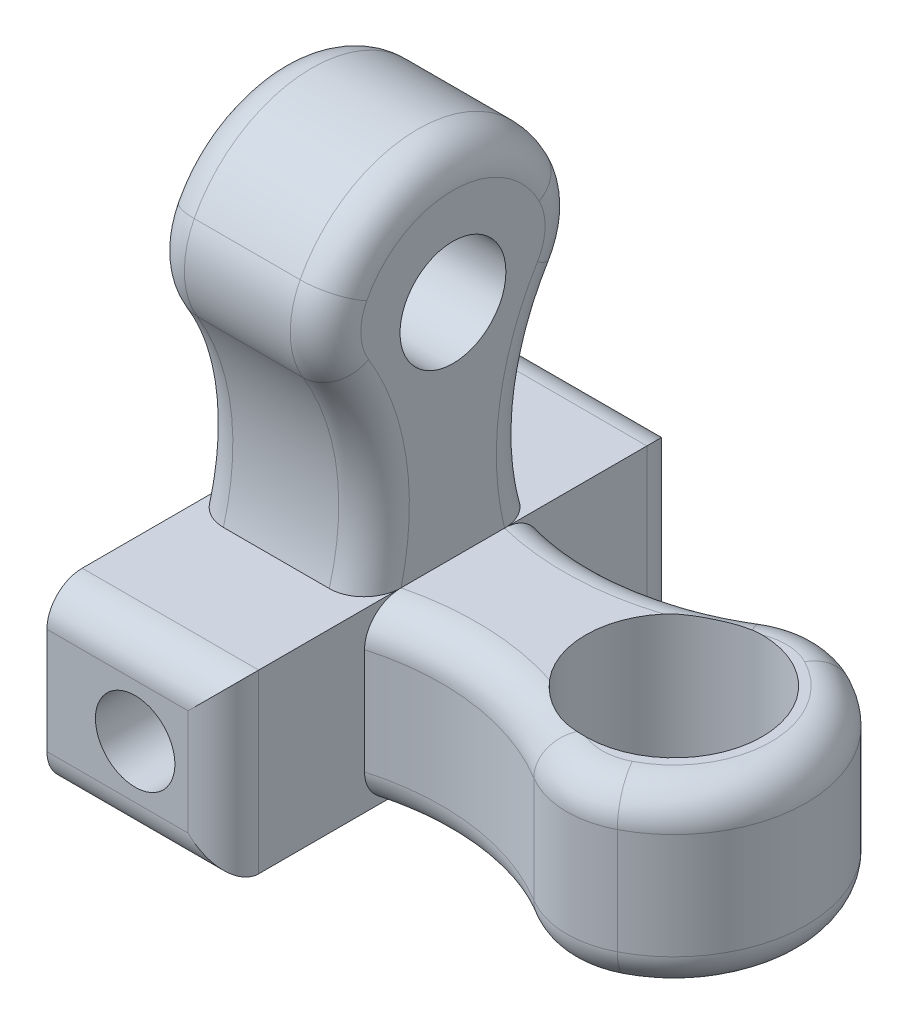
ISO-10303-21;
HEADER;
FILE_DESCRIPTION(('STEP AP214'),'2;1');
FILE_NAME('part.step','',(''),(''),'','','');
FILE_SCHEMA(('AUTOMOTIVE_DESIGN { 1 0 10303 214 1 1 1 1 }'));
ENDSEC;
DATA;
#1=APPLICATION_CONTEXT('core data for automotive mechanical design processes');
#2=APPLICATION_PROTOCOL_DEFINITION('international standard','automotive_design',2000,#1);
#3=PRODUCT_CONTEXT('',#1,'mechanical');
#4=PRODUCT('Part','Part','',(#3));
#5=PRODUCT_RELATED_PRODUCT_CATEGORY('part','',(#4));
#6=PRODUCT_DEFINITION_FORMATION('','',#4);
#7=PRODUCT_DEFINITION_CONTEXT('part definition',#1,'design');
#8=PRODUCT_DEFINITION('design','',#6,#7);
#9=PRODUCT_DEFINITION_SHAPE('','',#8);
#10=(LENGTH_UNIT() NAMED_UNIT(*) SI_UNIT(.MILLI.,.METRE.));
#11=(NAMED_UNIT(*) PLANE_ANGLE_UNIT() SI_UNIT($,.RADIAN.));
#12=(NAMED_UNIT(*) SI_UNIT($,.STERADIAN.) SOLID_ANGLE_UNIT());
#13=UNCERTAINTY_MEASURE_WITH_UNIT(LENGTH_MEASURE(1.E-05),#10,'distance_accuracy_value','');
#14=(GEOMETRIC_REPRESENTATION_CONTEXT(3) GLOBAL_UNCERTAINTY_ASSIGNED_CONTEXT((#13)) GLOBAL_UNIT_ASSIGNED_CONTEXT((#10,
#11,#12)) REPRESENTATION_CONTEXT('',''));
#15=CARTESIAN_POINT('',(0.,0.,0.));
#16=DIRECTION('',(0.,0.,1.));
#17=DIRECTION('',(1.,0.,0.));
#18=AXIS2_PLACEMENT_3D('',#15,#16,#17);
#19=CARTESIAN_POINT('',(0.,2.5,6.5));
#20=DIRECTION('',(0.,1.,0.));
#21=DIRECTION('',(-1.,0.,0.));
#22=AXIS2_PLACEMENT_3D('',#19,#20,#21);
#23=PLANE('',#22);
#24=CARTESIAN_POINT('',(8.76911496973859,2.5,0.00464177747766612));
#25=DIRECTION('',(0.,1.,0.));
#26=DIRECTION('',(-1.,0.,0.));
#27=AXIS2_PLACEMENT_3D('',#24,#25,#26);
#28=CIRCLE('',#27,2.5);
#29=CARTESIAN_POINT('',(6.86303285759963,2.5,-1.61302660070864));
#30=VERTEX_POINT('',#29);
#31=CARTESIAN_POINT('',(6.85830377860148,2.5,1.61672136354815));
#32=VERTEX_POINT('',#31);
#33=EDGE_CURVE('E722',#30,#32,#28,.T.);
#34=ORIENTED_EDGE('',*,*,#33,.F.);
#35=CARTESIAN_POINT('',(4.42109628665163,2.5,-9.23122492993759));
#36=DIRECTION('',(0.,1.,0.));
#37=DIRECTION('',(-1.,0.,0.));
#38=AXIS2_PLACEMENT_3D('',#35,#36,#37);
#39=CIRCLE('',#38,8.00000000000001);
#40=CARTESIAN_POINT('',(2.5,2.5,-1.46531293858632));
#41=VERTEX_POINT('',#40);
#42=EDGE_CURVE('E647',#30,#41,#39,.F.);
#43=ORIENTED_EDGE('',*,*,#42,.T.);
#44=DIRECTION('',(0.,0.,-1.));
#45=VECTOR('',#44,1.);
#46=CARTESIAN_POINT('',(2.5,2.5,6.5));
#47=LINE('',#46,#45);
#48=CARTESIAN_POINT('',(2.5,2.5,1.46531293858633));
#49=VERTEX_POINT('',#48);
#50=EDGE_CURVE('E301',#49,#41,#47,.T.);
#51=ORIENTED_EDGE('',*,*,#50,.F.);
#52=CARTESIAN_POINT('',(2.5,2.5,1.46531293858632));
#53=CARTESIAN_POINT('',(2.50004043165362,2.5,1.52488420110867));
#54=CARTESIAN_POINT('',(2.4949860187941,2.5,1.58444449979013));
#55=CARTESIAN_POINT('',(2.47502157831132,2.5,1.70188805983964));
#56=CARTESIAN_POINT('',(2.4601120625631,2.5,1.75977140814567));
#57=CARTESIAN_POINT('',(2.42075954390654,2.5,1.87224644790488));
#58=CARTESIAN_POINT('',(2.396310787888,2.5,1.92683612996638));
#59=CARTESIAN_POINT('',(2.33850981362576,2.5,2.03106393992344));
#60=CARTESIAN_POINT('',(2.3051605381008,2.5,2.0807036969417));
#61=CARTESIAN_POINT('',(2.23080967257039,2.5,2.17300187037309));
#62=CARTESIAN_POINT('',(2.18989455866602,2.5,2.21572985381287));
#63=CARTESIAN_POINT('',(2.10125147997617,2.5,2.29344831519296));
#64=CARTESIAN_POINT('',(2.05352290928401,2.5,2.32843810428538));
#65=CARTESIAN_POINT('',(1.95421718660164,2.5,2.38846325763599));
#66=CARTESIAN_POINT('',(1.90280795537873,2.5,2.41377671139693));
#67=CARTESIAN_POINT('',(1.79638470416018,2.5,2.45503277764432));
#68=CARTESIAN_POINT('',(1.74137490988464,2.5,2.47098616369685));
#69=CARTESIAN_POINT('',(1.65489189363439,2.5,2.48796071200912));
#70=CARTESIAN_POINT('',(1.62406544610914,2.5,2.4924727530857));
#71=CARTESIAN_POINT('',(1.56216464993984,2.5,2.49849122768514));
#72=CARTESIAN_POINT('',(1.5310907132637,2.5,2.50000190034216));
#73=CARTESIAN_POINT('',(1.50000000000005,2.5,2.50000000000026));
#74=B_SPLINE_CURVE_WITH_KNOTS('',3,(#52,#53,#54,#55,#56,#57,#58,#59,#60,#61,#62,#63,#64,#65,#66,
#67,#68,#69,#70,#71,#72,#73),.UNSPECIFIED.,.F.,.F.,(4,2,2,2,2,2,2,2,2,2,4),(0.,
0.178485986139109,0.356962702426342,0.535547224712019,0.714072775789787,0.890671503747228,
1.06728594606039,1.23835426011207,1.40922528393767,1.50255983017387,1.59576245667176),.UNSPECIFIED.);
#75=CARTESIAN_POINT('',(2.49999994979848,2.5,1.46563935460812));
#76=VERTEX_POINT('',#75);
#77=EDGE_CURVE('E395',#49,#76,#74,.T.);
#78=ORIENTED_EDGE('',*,*,#77,.T.);
#79=CARTESIAN_POINT('',(4.41248903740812,2.5,9.23367549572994));
#80=DIRECTION('',(0.,1.,0.));
#81=DIRECTION('',(-1.,0.,0.));
#82=AXIS2_PLACEMENT_3D('',#79,#80,#81);
#83=CIRCLE('',#82,8.);
#84=EDGE_CURVE('E766',#76,#32,#83,.F.);
#85=ORIENTED_EDGE('',*,*,#84,.T.);
#86=EDGE_LOOP('',(#34,#43,#51,#78,#85));
#87=FACE_BOUND('',#86,.T.);
#88=ADVANCED_FACE('F32',(#87),#23,.T.);
#89=CARTESIAN_POINT('',(1.5,2.5,-2.5));
#90=CARTESIAN_POINT('',(1.52739234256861,2.5,-2.5000004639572));
#91=CARTESIAN_POINT('',(1.55477124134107,2.5,-2.49882919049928));
#92=CARTESIAN_POINT('',(1.60932635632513,2.5,-2.49416086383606));
#93=CARTESIAN_POINT('',(1.6365025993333,2.5,-2.49066412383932));
#94=CARTESIAN_POINT('',(1.71732527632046,2.5,-2.47673753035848));
#95=CARTESIAN_POINT('',(1.77041930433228,2.5,-2.46287107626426));
#96=CARTESIAN_POINT('',(1.87350631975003,2.5,-2.42645523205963));
#97=CARTESIAN_POINT('',(1.923499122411,2.5,-2.40390532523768));
#98=CARTESIAN_POINT('',(2.01909161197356,2.5,-2.35087343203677));
#99=CARTESIAN_POINT('',(2.06469059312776,2.5,-2.32039017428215));
#100=CARTESIAN_POINT('',(2.15109886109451,2.5,-2.25184434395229));
#101=CARTESIAN_POINT('',(2.19180941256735,2.5,-2.21365750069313));
#102=CARTESIAN_POINT('',(2.26651476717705,2.5,-2.13119345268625));
#103=CARTESIAN_POINT('',(2.30050778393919,2.5,-2.08691463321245));
#104=CARTESIAN_POINT('',(2.36206223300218,2.5,-1.99185811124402));
#105=CARTESIAN_POINT('',(2.38935466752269,2.5,-1.94090632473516));
#106=CARTESIAN_POINT('',(2.43525521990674,2.5,-1.83523628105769));
#107=CARTESIAN_POINT('',(2.45386509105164,2.5,-1.78051878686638));
#108=CARTESIAN_POINT('',(2.47856429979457,2.5,-1.68234841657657));
#109=CARTESIAN_POINT('',(2.48659333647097,2.5,-1.63937224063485));
#110=CARTESIAN_POINT('',(2.49731178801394,2.5,-1.55281531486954));
#111=CARTESIAN_POINT('',(2.50000803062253,2.5,-1.50923541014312));
#112=CARTESIAN_POINT('',(2.5,2.5,-1.46563934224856));
#113=B_SPLINE_CURVE_WITH_KNOTS('',3,(#89,#90,#91,#92,#93,#94,#95,#96,#97,#98,#99,#100,#101,#102,
#103,#104,#105,#106,#107,#108,#109,#110,#111,#112),.UNSPECIFIED.,.F.,.F.,(4,2,2,2,2,2,2,2,2,2,2,
4),(0.,0.0821254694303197,0.164239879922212,0.328013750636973,0.491797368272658,
0.655607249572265,0.82230817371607,0.989053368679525,1.16167720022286,1.3342661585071,
1.46510830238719,1.59578281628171),.UNSPECIFIED.);
#114=CARTESIAN_POINT('',(1.49999999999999,2.5,-2.5));
#115=VERTEX_POINT('',#114);
#116=CARTESIAN_POINT('',(2.5,2.5,-1.46563934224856));
#117=VERTEX_POINT('',#116);
#118=EDGE_CURVE('E402',#115,#117,#113,.T.);
#119=ORIENTED_EDGE('',*,*,#118,.T.);
#120=DIRECTION('',(0.,0.,1.));
#121=VECTOR('',#120,1.);
#122=CARTESIAN_POINT('',(2.50000000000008,2.5,6.49999999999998));
#123=LINE('',#122,#121);
#124=CARTESIAN_POINT('',(2.49999999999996,2.5,-5.5));
#125=VERTEX_POINT('',#124);
#126=EDGE_CURVE('E673',#125,#117,#123,.T.);
#127=ORIENTED_EDGE('',*,*,#126,.F.);
#128=DIRECTION('',(1.,0.,0.));
#129=VECTOR('',#128,1.);
#130=CARTESIAN_POINT('',(-2.5,2.5,-5.5));
#131=LINE('',#130,#129);
#132=CARTESIAN_POINT('',(-2.5,2.5,-5.5));
#133=VERTEX_POINT('',#132);
#134=EDGE_CURVE('E742',#125,#133,#131,.F.);
#135=ORIENTED_EDGE('',*,*,#134,.T.);
#136=DIRECTION('',(0.,0.,-1.));
#137=VECTOR('',#136,1.);
#138=CARTESIAN_POINT('',(-2.5,2.5,6.5));
#139=LINE('',#138,#137);
#140=CARTESIAN_POINT('',(-2.5,2.5,-1.46563934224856));
#141=VERTEX_POINT('',#140);
#142=EDGE_CURVE('E684',#141,#133,#139,.T.);
#143=ORIENTED_EDGE('',*,*,#142,.F.);
#144=CARTESIAN_POINT('',(-2.5,2.5,-1.46563934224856));
#145=CARTESIAN_POINT('',(-2.50004050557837,2.5,-1.52517884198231));
#146=CARTESIAN_POINT('',(-2.49498863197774,2.5,-1.58470734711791));
#147=CARTESIAN_POINT('',(-2.47503437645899,2.5,-1.7020877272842));
#148=CARTESIAN_POINT('',(-2.46013257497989,2.5,-1.75993970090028));
#149=CARTESIAN_POINT('',(-2.42080078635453,2.5,-1.87235366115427));
#150=CARTESIAN_POINT('',(-2.39636505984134,2.5,-1.92691364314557));
#151=CARTESIAN_POINT('',(-2.33859592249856,2.5,-2.03108532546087));
#152=CARTESIAN_POINT('',(-2.30526544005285,2.5,-2.08069864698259));
#153=CARTESIAN_POINT('',(-2.23095414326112,2.5,-2.17295453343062));
#154=CARTESIAN_POINT('',(-2.19005888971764,2.5,-2.21566592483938));
#155=CARTESIAN_POINT('',(-2.10146017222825,2.5,-2.29335755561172));
#156=CARTESIAN_POINT('',(-2.05375609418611,2.5,-2.3283370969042));
#157=CARTESIAN_POINT('',(-1.95448719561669,2.5,-2.38836037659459));
#158=CARTESIAN_POINT('',(-1.90308860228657,2.5,-2.41367930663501));
#159=CARTESIAN_POINT('',(-1.79668640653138,2.5,-2.45495162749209));
#160=CARTESIAN_POINT('',(-1.74168700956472,2.5,-2.47091573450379));
#161=CARTESIAN_POINT('',(-1.65516157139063,2.5,-2.48792290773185));
#162=CARTESIAN_POINT('',(-1.62428194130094,2.5,-2.49244911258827));
#163=CARTESIAN_POINT('',(-1.5622735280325,2.5,-2.49848649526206));
#164=CARTESIAN_POINT('',(-1.53114515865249,2.5,-2.50000192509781));
#165=CARTESIAN_POINT('',(-1.50000000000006,2.5,-2.50000000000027));
#166=B_SPLINE_CURVE_WITH_KNOTS('',3,(#144,#145,#146,#147,#148,#149,#150,#151,#152,#153,#154,
#155,#156,#157,#158,#159,#160,#161,#162,#163,#164,#165),.UNSPECIFIED.,.F.,.F.,(4,2,2,2,2,2,2,2,
2,2,4),(0.,0.17839073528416,0.356770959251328,0.535258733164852,0.713687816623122,
0.890210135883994,1.06674838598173,1.23779582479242,1.40864693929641,1.50214485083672,
1.59551062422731),.UNSPECIFIED.);
#167=CARTESIAN_POINT('',(-1.5,2.5,-2.5));
#168=VERTEX_POINT('',#167);
#169=EDGE_CURVE('E370',#141,#168,#166,.T.);
#170=ORIENTED_EDGE('',*,*,#169,.T.);
#171=DIRECTION('',(1.,0.,0.));
#172=VECTOR('',#171,1.);
#173=CARTESIAN_POINT('',(-6.5,2.5,-2.5));
#174=LINE('',#173,#172);
#175=EDGE_CURVE('E681',#168,#115,#174,.T.);
#176=ORIENTED_EDGE('',*,*,#175,.T.);
#177=EDGE_LOOP('',(#119,#127,#135,#143,#170,#176));
#178=FACE_BOUND('',#177,.T.);
#179=ADVANCED_FACE('F822',(#178),#23,.T.);
#180=DIRECTION('',(0.,0.,1.));
#181=VECTOR('',#180,1.);
#182=CARTESIAN_POINT('',(2.50000000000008,2.5,6.49999999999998));
#183=LINE('',#182,#181);
#184=CARTESIAN_POINT('',(2.50000000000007,2.5,5.5));
#185=VERTEX_POINT('',#184);
#186=EDGE_CURVE('E273',#76,#185,#183,.T.);
#187=ORIENTED_EDGE('',*,*,#186,.F.);
#188=CARTESIAN_POINT('',(1.49999999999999,2.5,2.5));
#189=VERTEX_POINT('',#188);
#190=EDGE_CURVE('E403',#76,#189,#74,.T.);
#191=ORIENTED_EDGE('',*,*,#190,.T.);
#192=DIRECTION('',(1.,0.,0.));
#193=VECTOR('',#192,1.);
#194=CARTESIAN_POINT('',(-6.5,2.5,2.5));
#195=LINE('',#194,#193);
#196=CARTESIAN_POINT('',(-1.5,2.5,2.5));
#197=VERTEX_POINT('',#196);
#198=EDGE_CURVE('E680',#197,#189,#195,.T.);
#199=ORIENTED_EDGE('',*,*,#198,.F.);
#200=CARTESIAN_POINT('',(-1.5,2.5,2.5));
#201=CARTESIAN_POINT('',(-1.52738554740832,2.5,2.50000046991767));
#202=CARTESIAN_POINT('',(-1.55475765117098,2.5,2.49882934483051));
#203=CARTESIAN_POINT('',(-1.60929916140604,2.5,2.49416164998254));
#204=CARTESIAN_POINT('',(-1.63646859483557,2.5,2.49066539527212));
#205=CARTESIAN_POINT('',(-1.71727035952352,2.5,2.47674092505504));
#206=CARTESIAN_POINT('',(-1.77035031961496,2.5,2.46287677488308));
#207=CARTESIAN_POINT('',(-1.87340960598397,2.5,2.42646812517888));
#208=CARTESIAN_POINT('',(-1.92338875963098,2.5,2.40392314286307));
#209=CARTESIAN_POINT('',(-2.01895586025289,2.5,2.35090449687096));
#210=CARTESIAN_POINT('',(-2.06454308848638,2.5,2.32042953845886));
#211=CARTESIAN_POINT('',(-2.15093784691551,2.5,2.25189906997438));
#212=CARTESIAN_POINT('',(-2.19164581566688,2.5,2.21371824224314));
#213=CARTESIAN_POINT('',(-2.26634937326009,2.5,2.13126846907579));
#214=CARTESIAN_POINT('',(-2.30034317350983,2.5,2.08699790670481));
#215=CARTESIAN_POINT('',(-2.36191419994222,2.5,1.99194478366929));
#216=CARTESIAN_POINT('',(-2.38922008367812,2.5,1.94098656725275));
#217=CARTESIAN_POINT('',(-2.43514881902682,2.5,1.83530232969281));
#218=CARTESIAN_POINT('',(-2.45377339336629,2.5,1.78057705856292));
#219=CARTESIAN_POINT('',(-2.47851330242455,2.5,1.68233816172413));
#220=CARTESIAN_POINT('',(-2.48656139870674,2.5,1.63930003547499));
#221=CARTESIAN_POINT('',(-2.49730535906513,2.5,1.55261707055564));
#222=CARTESIAN_POINT('',(-2.50000806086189,2.5,1.50897307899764));
#223=CARTESIAN_POINT('',(-2.5,2.5,1.46531293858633));
#224=B_SPLINE_CURVE_WITH_KNOTS('',3,(#200,#201,#202,#203,#204,#205,#206,#207,#208,#209,#210,
#211,#212,#213,#214,#215,#216,#217,#218,#219,#220,#221,#222,#223),.UNSPECIFIED.,.F.,.F.,(4,2,2,
2,2,2,2,2,2,2,2,4),(0.,0.0821050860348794,0.164199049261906,0.327930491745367,0.491671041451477,
0.655438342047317,0.822121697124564,0.988849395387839,1.16150939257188,1.33413511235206,
1.46516933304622,1.59603582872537),.UNSPECIFIED.);
#225=CARTESIAN_POINT('',(-2.5,2.5,1.46531293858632));
#226=VERTEX_POINT('',#225);
#227=EDGE_CURVE('E361',#197,#226,#224,.T.);
#228=ORIENTED_EDGE('',*,*,#227,.T.);
#229=DIRECTION('',(0.,0.,-1.));
#230=VECTOR('',#229,1.);
#231=CARTESIAN_POINT('',(-2.5,2.5,6.5));
#232=LINE('',#231,#230);
#233=CARTESIAN_POINT('',(-2.5,2.5,5.5));
#234=VERTEX_POINT('',#233);
#235=EDGE_CURVE('E701',#234,#226,#232,.T.);
#236=ORIENTED_EDGE('',*,*,#235,.F.);
#237=DIRECTION('',(1.,0.,0.));
#238=VECTOR('',#237,1.);
#239=CARTESIAN_POINT('',(0.,2.5,5.5));
#240=LINE('',#239,#238);
#241=EDGE_CURVE('E278',#234,#185,#240,.T.);
#242=ORIENTED_EDGE('',*,*,#241,.T.);
#243=EDGE_LOOP('',(#187,#191,#199,#228,#236,#242));
#244=FACE_BOUND('',#243,.T.);
#245=ADVANCED_FACE('F387',(#244),#23,.T.);
#246=CARTESIAN_POINT('',(0.,-2.5,6.5));
#247=DIRECTION('',(0.,1.,0.));
#248=DIRECTION('',(0.,0.,1.));
#249=AXIS2_PLACEMENT_3D('',#246,#247,#248);
#250=PLANE('',#249);
#251=DIRECTION('',(0.,0.,1.));
#252=VECTOR('',#251,1.);
#253=CARTESIAN_POINT('',(2.50000000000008,-2.5,6.49999999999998));
#254=LINE('',#253,#252);
#255=CARTESIAN_POINT('',(2.49999999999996,-2.5,-5.50000000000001));
#256=VERTEX_POINT('',#255);
#257=CARTESIAN_POINT('',(2.5,-2.5,-1.46531293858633));
#258=VERTEX_POINT('',#257);
#259=EDGE_CURVE('E671',#256,#258,#254,.T.);
#260=ORIENTED_EDGE('',*,*,#259,.T.);
#261=CARTESIAN_POINT('',(4.42109628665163,-2.5,-9.23122492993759));
#262=DIRECTION('',(0.,1.,0.));
#263=DIRECTION('',(0.,0.,1.));
#264=AXIS2_PLACEMENT_3D('',#261,#262,#263);
#265=CIRCLE('',#264,8.00000000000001);
#266=CARTESIAN_POINT('',(6.86303285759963,-2.5,-1.61302660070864));
#267=VERTEX_POINT('',#266);
#268=EDGE_CURVE('E630',#258,#267,#265,.T.);
#269=ORIENTED_EDGE('',*,*,#268,.T.);
#270=CARTESIAN_POINT('',(8.76911496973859,-2.5,0.00464177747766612));
#271=DIRECTION('',(0.,1.,0.));
#272=DIRECTION('',(0.,0.,1.));
#273=AXIS2_PLACEMENT_3D('',#270,#271,#272);
#274=CIRCLE('',#273,2.5);
#275=CARTESIAN_POINT('',(6.85830377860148,-2.5,1.61672136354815));
#276=VERTEX_POINT('',#275);
#277=EDGE_CURVE('E723',#267,#276,#274,.T.);
#278=ORIENTED_EDGE('',*,*,#277,.T.);
#279=CARTESIAN_POINT('',(4.41248903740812,-2.5,9.23367549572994));
#280=DIRECTION('',(0.,1.,0.));
#281=DIRECTION('',(0.,0.,1.));
#282=AXIS2_PLACEMENT_3D('',#279,#280,#281);
#283=CIRCLE('',#282,8.);
#284=CARTESIAN_POINT('',(2.50000000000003,-2.5,1.46563934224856));
#285=VERTEX_POINT('',#284);
#286=EDGE_CURVE('E289',#276,#285,#283,.T.);
#287=ORIENTED_EDGE('',*,*,#286,.T.);
#288=DIRECTION('',(0.,0.,1.));
#289=VECTOR('',#288,1.);
#290=CARTESIAN_POINT('',(2.50000000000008,-2.5,6.49999999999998));
#291=LINE('',#290,#289);
#292=CARTESIAN_POINT('',(2.50000000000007,-2.5,5.49999999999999));
#293=VERTEX_POINT('',#292);
#294=EDGE_CURVE('E271',#285,#293,#291,.T.);
#295=ORIENTED_EDGE('',*,*,#294,.T.);
#296=DIRECTION('',(1.,0.,0.));
#297=VECTOR('',#296,1.);
#298=CARTESIAN_POINT('',(-2.5,-2.5,5.5));
#299=LINE('',#298,#297);
#300=CARTESIAN_POINT('',(-2.5,-2.5,5.5));
#301=VERTEX_POINT('',#300);
#302=EDGE_CURVE('E285',#293,#301,#299,.F.);
#303=ORIENTED_EDGE('',*,*,#302,.T.);
#304=DIRECTION('',(0.,0.,-1.));
#305=VECTOR('',#304,1.);
#306=CARTESIAN_POINT('',(-2.5,-2.5,6.5));
#307=LINE('',#306,#305);
#308=CARTESIAN_POINT('',(-2.5,-2.5,-5.5));
#309=VERTEX_POINT('',#308);
#310=EDGE_CURVE('E711',#301,#309,#307,.T.);
#311=ORIENTED_EDGE('',*,*,#310,.T.);
#312=DIRECTION('',(1.,0.,0.));
#313=VECTOR('',#312,1.);
#314=CARTESIAN_POINT('',(0.,-2.5,-5.5));
#315=LINE('',#314,#313);
#316=EDGE_CURVE('E300',#309,#256,#315,.T.);
#317=ORIENTED_EDGE('',*,*,#316,.T.);
#318=EDGE_LOOP('',(#260,#269,#278,#287,#295,#303,#311,#317));
#319=FACE_BOUND('',#318,.T.);
#320=ADVANCED_FACE('F283',(#319),#250,.F.);
#321=CARTESIAN_POINT('',(8.76911496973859,2.5,0.00464177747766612));
#322=DIRECTION('',(0.,1.,0.));
#323=DIRECTION('',(-1.,0.,0.));
#324=AXIS2_PLACEMENT_3D('',#321,#322,#323);
#325=CIRCLE('',#324,2.75);
#326=CARTESIAN_POINT('',(10.0351633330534,2.5,2.44587538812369));
#327=VERTEX_POINT('',#326);
#328=CARTESIAN_POINT('',(10.0320096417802,2.5,-2.43822478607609));
#329=VERTEX_POINT('',#328);
#330=EDGE_CURVE('E50',#327,#329,#325,.T.);
#331=ORIENTED_EDGE('',*,*,#330,.T.);
#332=CARTESIAN_POINT('',(9.34315800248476,2.5,-1.10575211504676));
#333=DIRECTION('',(0.,1.,0.));
#334=DIRECTION('',(-1.,0.,0.));
#335=AXIS2_PLACEMENT_3D('',#332,#333,#334);
#336=CIRCLE('',#335,1.5);
#337=CARTESIAN_POINT('',(8.77832000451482,2.5,-2.49534127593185));
#338=VERTEX_POINT('',#337);
#339=EDGE_CURVE('E849',#329,#338,#336,.T.);
#340=ORIENTED_EDGE('',*,*,#339,.T.);
#341=CARTESIAN_POINT('',(8.78154850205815,2.5,2.50461085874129));
#342=VERTEX_POINT('',#341);
#343=EDGE_CURVE('E639',#342,#338,#28,.T.);
#344=ORIENTED_EDGE('',*,*,#343,.F.);
#345=CARTESIAN_POINT('',(9.34459149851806,2.5,1.1142934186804));
#346=DIRECTION('',(0.,1.,0.));
#347=DIRECTION('',(-1.,0.,0.));
#348=AXIS2_PLACEMENT_3D('',#345,#346,#347);
#349=CIRCLE('',#348,1.5);
#350=EDGE_CURVE('E55',#342,#327,#349,.T.);
#351=ORIENTED_EDGE('',*,*,#350,.T.);
#352=EDGE_LOOP('',(#331,#340,#344,#351));
#353=FACE_BOUND('',#352,.T.);
#354=ADVANCED_FACE('F381',(#353),#23,.T.);
#355=CARTESIAN_POINT('',(2.5,0.,6.5));
#356=DIRECTION('',(1.,0.,0.));
#357=DIRECTION('',(0.,0.,-1.));
#358=AXIS2_PLACEMENT_3D('',#355,#356,#357);
#359=PLANE('',#358);
#360=CARTESIAN_POINT('',(2.5,9.34315800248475,1.10575211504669));
#361=DIRECTION('',(1.,0.,0.));
#362=DIRECTION('',(0.,0.,-1.));
#363=AXIS2_PLACEMENT_3D('',#360,#361,#362);
#364=CIRCLE('',#363,1.5);
#365=CARTESIAN_POINT('',(2.5,10.0320096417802,2.43822478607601));
#366=VERTEX_POINT('',#365);
#367=CARTESIAN_POINT('',(2.5,8.5659903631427,2.38872150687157));
#368=VERTEX_POINT('',#367);
#369=EDGE_CURVE('E353',#366,#368,#364,.T.);
#370=ORIENTED_EDGE('',*,*,#369,.T.);
#371=CARTESIAN_POINT('',(2.5,4.42109628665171,9.23122492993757));
#372=DIRECTION('',(1.,0.,0.));
#373=DIRECTION('',(0.,0.,-1.));
#374=AXIS2_PLACEMENT_3D('',#371,#372,#373);
#375=CIRCLE('',#374,8.);
#376=EDGE_CURVE('E355',#368,#49,#375,.F.);
#377=ORIENTED_EDGE('',*,*,#376,.T.);
#378=ORIENTED_EDGE('',*,*,#50,.T.);
#379=EDGE_CURVE('E717',#41,#117,#47,.T.);
#380=ORIENTED_EDGE('',*,*,#379,.T.);
#381=CARTESIAN_POINT('',(2.5,4.412489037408,-9.23367549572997));
#382=DIRECTION('',(1.,0.,0.));
#383=DIRECTION('',(0.,0.,-1.));
#384=AXIS2_PLACEMENT_3D('',#381,#382,#383);
#385=CIRCLE('',#384,8.);
#386=CARTESIAN_POINT('',(2.5,8.56583847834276,-2.39630111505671));
#387=VERTEX_POINT('',#386);
#388=EDGE_CURVE('E351',#117,#387,#385,.F.);
#389=ORIENTED_EDGE('',*,*,#388,.T.);
#390=CARTESIAN_POINT('',(2.5,9.34459149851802,-1.11429341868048));
#391=DIRECTION('',(1.,0.,0.));
#392=DIRECTION('',(0.,0.,-1.));
#393=AXIS2_PLACEMENT_3D('',#390,#391,#392);
#394=CIRCLE('',#393,1.5);
#395=CARTESIAN_POINT('',(2.5,10.0351633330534,-2.44587538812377));
#396=VERTEX_POINT('',#395);
#397=EDGE_CURVE('E349',#387,#396,#394,.T.);
#398=ORIENTED_EDGE('',*,*,#397,.T.);
#399=CARTESIAN_POINT('',(2.5,8.76911496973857,-0.00464177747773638));
#400=DIRECTION('',(1.,0.,0.));
#401=DIRECTION('',(0.,0.,-1.));
#402=AXIS2_PLACEMENT_3D('',#399,#400,#401);
#403=CIRCLE('',#402,2.75);
#404=EDGE_CURVE('E347',#396,#366,#403,.T.);
#405=ORIENTED_EDGE('',*,*,#404,.T.);
#406=EDGE_LOOP('',(#370,#377,#378,#380,#389,#398,#405));
#407=FACE_BOUND('',#406,.T.);
#408=CARTESIAN_POINT('',(2.5,8.76911496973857,-0.00464177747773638));
#409=DIRECTION('',(1.,0.,0.));
#410=DIRECTION('',(0.,0.,-1.));
#411=AXIS2_PLACEMENT_3D('',#408,#409,#410);
#412=CIRCLE('',#411,1.5);
#413=CARTESIAN_POINT('',(2.5,8.76911496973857,-1.50464177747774));
#414=VERTEX_POINT('',#413);
#415=EDGE_CURVE('E677',#414,#414,#412,.T.);
#416=ORIENTED_EDGE('',*,*,#415,.F.);
#417=EDGE_LOOP('',(#416));
#418=FACE_BOUND('',#417,.T.);
#419=ADVANCED_FACE('F386',(#407,#418),#359,.T.);
#420=CARTESIAN_POINT('',(-2.5,0.,6.5));
#421=DIRECTION('',(1.,0.,0.));
#422=DIRECTION('',(0.,0.,-1.));
#423=AXIS2_PLACEMENT_3D('',#420,#421,#422);
#424=PLANE('',#423);
#425=ORIENTED_EDGE('',*,*,#235,.T.);
#426=CARTESIAN_POINT('',(-2.5,4.42109628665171,9.23122492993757));
#427=DIRECTION('',(1.,0.,0.));
#428=DIRECTION('',(0.,0.,-1.));
#429=AXIS2_PLACEMENT_3D('',#426,#427,#428);
#430=CIRCLE('',#429,8.);
#431=CARTESIAN_POINT('',(-2.5,8.5659903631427,2.38872150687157));
#432=VERTEX_POINT('',#431);
#433=EDGE_CURVE('E327',#226,#432,#430,.T.);
#434=ORIENTED_EDGE('',*,*,#433,.T.);
#435=CARTESIAN_POINT('',(-2.5,9.34315800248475,1.10575211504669));
#436=DIRECTION('',(1.,0.,0.));
#437=DIRECTION('',(0.,0.,-1.));
#438=AXIS2_PLACEMENT_3D('',#435,#436,#437);
#439=CIRCLE('',#438,1.5);
#440=CARTESIAN_POINT('',(-2.5,10.0320096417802,2.43822478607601));
#441=VERTEX_POINT('',#440);
#442=EDGE_CURVE('E325',#432,#441,#439,.F.);
#443=ORIENTED_EDGE('',*,*,#442,.T.);
#444=CARTESIAN_POINT('',(-2.5,8.76911496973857,-0.00464177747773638));
#445=DIRECTION('',(1.,0.,0.));
#446=DIRECTION('',(0.,0.,-1.));
#447=AXIS2_PLACEMENT_3D('',#444,#445,#446);
#448=CIRCLE('',#447,2.75);
#449=CARTESIAN_POINT('',(-2.5,10.0351633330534,-2.44587538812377));
#450=VERTEX_POINT('',#449);
#451=EDGE_CURVE('E318',#441,#450,#448,.F.);
#452=ORIENTED_EDGE('',*,*,#451,.T.);
#453=CARTESIAN_POINT('',(-2.5,9.34459149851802,-1.11429341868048));
#454=DIRECTION('',(1.,0.,0.));
#455=DIRECTION('',(0.,0.,-1.));
#456=AXIS2_PLACEMENT_3D('',#453,#454,#455);
#457=CIRCLE('',#456,1.5);
#458=CARTESIAN_POINT('',(-2.5,8.56583847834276,-2.39630111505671));
#459=VERTEX_POINT('',#458);
#460=EDGE_CURVE('E320',#450,#459,#457,.F.);
#461=ORIENTED_EDGE('',*,*,#460,.T.);
#462=CARTESIAN_POINT('',(-2.5,4.412489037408,-9.23367549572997));
#463=DIRECTION('',(1.,0.,0.));
#464=DIRECTION('',(0.,0.,-1.));
#465=AXIS2_PLACEMENT_3D('',#462,#463,#464);
#466=CIRCLE('',#465,8.);
#467=EDGE_CURVE('E322',#459,#141,#466,.T.);
#468=ORIENTED_EDGE('',*,*,#467,.T.);
#469=ORIENTED_EDGE('',*,*,#142,.T.);
#470=CARTESIAN_POINT('',(-2.5,1.5,-5.5));
#471=DIRECTION('',(1.,0.,0.));
#472=DIRECTION('',(0.,0.,-1.));
#473=AXIS2_PLACEMENT_3D('',#470,#471,#472);
#474=CIRCLE('',#473,1.);
#475=CARTESIAN_POINT('',(-2.5,1.5,-6.5));
#476=VERTEX_POINT('',#475);
#477=EDGE_CURVE('E736',#133,#476,#474,.F.);
#478=ORIENTED_EDGE('',*,*,#477,.T.);
#479=DIRECTION('',(0.,-1.,0.));
#480=VECTOR('',#479,1.);
#481=CARTESIAN_POINT('',(-2.5,0.,-6.5));
#482=LINE('',#481,#480);
#483=CARTESIAN_POINT('',(-2.5,-1.5,-6.5));
#484=VERTEX_POINT('',#483);
#485=EDGE_CURVE('E703',#476,#484,#482,.T.);
#486=ORIENTED_EDGE('',*,*,#485,.T.);
#487=CARTESIAN_POINT('',(-2.5,-1.5,-5.5));
#488=DIRECTION('',(1.,0.,0.));
#489=DIRECTION('',(0.,0.,-1.));
#490=AXIS2_PLACEMENT_3D('',#487,#488,#489);
#491=CIRCLE('',#490,1.);
#492=EDGE_CURVE('E738',#484,#309,#491,.F.);
#493=ORIENTED_EDGE('',*,*,#492,.T.);
#494=ORIENTED_EDGE('',*,*,#310,.F.);
#495=CARTESIAN_POINT('',(-2.5,-1.5,5.5));
#496=DIRECTION('',(1.,0.,0.));
#497=DIRECTION('',(0.,0.,-1.));
#498=AXIS2_PLACEMENT_3D('',#495,#496,#497);
#499=CIRCLE('',#498,1.);
#500=CARTESIAN_POINT('',(-2.5,-1.5,6.5));
#501=VERTEX_POINT('',#500);
#502=EDGE_CURVE('E299',#301,#501,#499,.F.);
#503=ORIENTED_EDGE('',*,*,#502,.T.);
#504=DIRECTION('',(0.,-1.,0.));
#505=VECTOR('',#504,1.);
#506=CARTESIAN_POINT('',(-2.5,0.,6.5));
#507=LINE('',#506,#505);
#508=CARTESIAN_POINT('',(-2.5,1.5,6.5));
#509=VERTEX_POINT('',#508);
#510=EDGE_CURVE('E704',#509,#501,#507,.T.);
#511=ORIENTED_EDGE('',*,*,#510,.F.);
#512=CARTESIAN_POINT('',(-2.5,1.5,5.5));
#513=DIRECTION('',(1.,0.,0.));
#514=DIRECTION('',(0.,0.,-1.));
#515=AXIS2_PLACEMENT_3D('',#512,#513,#514);
#516=CIRCLE('',#515,1.);
#517=EDGE_CURVE('E733',#509,#234,#516,.F.);
#518=ORIENTED_EDGE('',*,*,#517,.T.);
#519=EDGE_LOOP('',(#425,#434,#443,#452,#461,#468,#469,#478,#486,#493,#494,#503,#511,#518));
#520=FACE_BOUND('',#519,.T.);
#521=CARTESIAN_POINT('',(-2.5,8.76911496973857,-0.00464177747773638));
#522=DIRECTION('',(1.,0.,0.));
#523=DIRECTION('',(0.,0.,-1.));
#524=AXIS2_PLACEMENT_3D('',#521,#522,#523);
#525=CIRCLE('',#524,1.5);
#526=CARTESIAN_POINT('',(-2.5,8.76911496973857,-1.50464177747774));
#527=VERTEX_POINT('',#526);
#528=EDGE_CURVE('E676',#527,#527,#525,.T.);
#529=ORIENTED_EDGE('',*,*,#528,.T.);
#530=EDGE_LOOP('',(#529));
#531=FACE_BOUND('',#530,.T.);
#532=ADVANCED_FACE('F839',(#520,#531),#424,.F.);
#533=CARTESIAN_POINT('',(8.78154850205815,-2.5,2.50461085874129));
#534=VERTEX_POINT('',#533);
#535=CARTESIAN_POINT('',(8.77832000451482,-2.5,-2.49534127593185));
#536=VERTEX_POINT('',#535);
#537=EDGE_CURVE('E569',#534,#536,#274,.T.);
#538=ORIENTED_EDGE('',*,*,#537,.T.);
#539=CARTESIAN_POINT('',(9.34315800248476,-2.5,-1.10575211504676));
#540=DIRECTION('',(0.,1.,0.));
#541=DIRECTION('',(0.,0.,1.));
#542=AXIS2_PLACEMENT_3D('',#539,#540,#541);
#543=CIRCLE('',#542,1.5);
#544=CARTESIAN_POINT('',(10.0320096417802,-2.5,-2.43822478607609));
#545=VERTEX_POINT('',#544);
#546=EDGE_CURVE('E613',#536,#545,#543,.F.);
#547=ORIENTED_EDGE('',*,*,#546,.T.);
#548=CARTESIAN_POINT('',(8.76911496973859,-2.5,0.00464177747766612));
#549=DIRECTION('',(0.,1.,0.));
#550=DIRECTION('',(0.,0.,1.));
#551=AXIS2_PLACEMENT_3D('',#548,#549,#550);
#552=CIRCLE('',#551,2.75);
#553=CARTESIAN_POINT('',(10.0351633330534,-2.5,2.44587538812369));
#554=VERTEX_POINT('',#553);
#555=EDGE_CURVE('E619',#545,#554,#552,.F.);
#556=ORIENTED_EDGE('',*,*,#555,.T.);
#557=CARTESIAN_POINT('',(9.34459149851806,-2.5,1.1142934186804));
#558=DIRECTION('',(0.,1.,0.));
#559=DIRECTION('',(0.,0.,1.));
#560=AXIS2_PLACEMENT_3D('',#557,#558,#559);
#561=CIRCLE('',#560,1.5);
#562=EDGE_CURVE('E621',#554,#534,#561,.F.);
#563=ORIENTED_EDGE('',*,*,#562,.T.);
#564=EDGE_LOOP('',(#538,#547,#556,#563));
#565=FACE_BOUND('',#564,.T.);
#566=ADVANCED_FACE('F859',(#565),#250,.F.);
#567=CARTESIAN_POINT('',(0.,0.,6.5));
#568=DIRECTION('',(0.,0.,-1.));
#569=DIRECTION('',(-1.,0.,0.));
#570=AXIS2_PLACEMENT_3D('',#567,#568,#569);
#571=CYLINDRICAL_SURFACE('',#570,1.12500000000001);
#572=CARTESIAN_POINT('',(0.,0.,6.5));
#573=DIRECTION('',(0.,0.,1.));
#574=DIRECTION('',(1.,0.,0.));
#575=AXIS2_PLACEMENT_3D('',#572,#573,#574);
#576=CIRCLE('',#575,1.12500000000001);
#577=CARTESIAN_POINT('',(-1.12500000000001,0.,6.5));
#578=VERTEX_POINT('',#577);
#579=EDGE_CURVE('E707',#578,#578,#576,.F.);
#580=CARTESIAN_POINT('',(0.,0.,-6.5));
#581=DIRECTION('',(0.,0.,1.));
#582=DIRECTION('',(1.,0.,0.));
#583=AXIS2_PLACEMENT_3D('',#580,#581,#582);
#584=CIRCLE('',#583,1.12500000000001);
#585=CARTESIAN_POINT('',(-1.12500000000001,0.,-6.5));
#586=VERTEX_POINT('',#585);
#587=EDGE_CURVE('E708',#586,#586,#584,.F.);
#588=CARTESIAN_POINT('',(-1.12500000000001,0.,6.5));
#589=CARTESIAN_POINT('',(-1.12500000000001,0.,6.36458333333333));
#590=CARTESIAN_POINT('',(-1.12500000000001,0.,6.22916666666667));
#591=CARTESIAN_POINT('',(-1.12500000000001,0.,5.95833333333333));
#592=CARTESIAN_POINT('',(-1.12500000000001,0.,5.82291666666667));
#593=CARTESIAN_POINT('',(-1.12500000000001,0.,5.55208333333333));
#594=CARTESIAN_POINT('',(-1.12500000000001,0.,5.41666666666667));
#595=CARTESIAN_POINT('',(-1.12500000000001,0.,5.14583333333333));
#596=CARTESIAN_POINT('',(-1.12500000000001,0.,5.01041666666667));
#597=CARTESIAN_POINT('',(-1.12500000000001,0.,4.73958333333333));
#598=CARTESIAN_POINT('',(-1.12500000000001,0.,4.60416666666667));
#599=CARTESIAN_POINT('',(-1.12500000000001,0.,4.33333333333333));
#600=CARTESIAN_POINT('',(-1.12500000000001,0.,4.19791666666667));
#601=CARTESIAN_POINT('',(-1.12500000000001,0.,3.92708333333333));
#602=CARTESIAN_POINT('',(-1.12500000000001,0.,3.79166666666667));
#603=CARTESIAN_POINT('',(-1.12500000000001,0.,3.52083333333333));
#604=CARTESIAN_POINT('',(-1.12500000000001,0.,3.38541666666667));
#605=CARTESIAN_POINT('',(-1.12500000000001,0.,3.11458333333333));
#606=CARTESIAN_POINT('',(-1.12500000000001,0.,2.97916666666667));
#607=CARTESIAN_POINT('',(-1.12500000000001,0.,2.70833333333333));
#608=CARTESIAN_POINT('',(-1.12500000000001,0.,2.57291666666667));
#609=CARTESIAN_POINT('',(-1.12500000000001,0.,2.30208333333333));
#610=CARTESIAN_POINT('',(-1.12500000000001,0.,2.16666666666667));
#611=CARTESIAN_POINT('',(-1.12500000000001,0.,1.89583333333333));
#612=CARTESIAN_POINT('',(-1.12500000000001,0.,1.76041666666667));
#613=CARTESIAN_POINT('',(-1.12500000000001,0.,1.48958333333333));
#614=CARTESIAN_POINT('',(-1.12500000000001,0.,1.35416666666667));
#615=CARTESIAN_POINT('',(-1.12500000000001,0.,1.08333333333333));
#616=CARTESIAN_POINT('',(-1.12500000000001,0.,0.947916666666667));
#617=CARTESIAN_POINT('',(-1.12500000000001,0.,0.677083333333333));
#618=CARTESIAN_POINT('',(-1.12500000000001,0.,0.541666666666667));
#619=CARTESIAN_POINT('',(-1.12500000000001,0.,0.270833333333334));
#620=CARTESIAN_POINT('',(-1.12500000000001,0.,0.135416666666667));
#621=CARTESIAN_POINT('',(-1.12500000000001,0.,-0.135416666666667));
#622=CARTESIAN_POINT('',(-1.12500000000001,0.,-0.270833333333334));
#623=CARTESIAN_POINT('',(-1.12500000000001,0.,-0.541666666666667));
#624=CARTESIAN_POINT('',(-1.12500000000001,0.,-0.677083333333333));
#625=CARTESIAN_POINT('',(-1.12500000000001,0.,-0.947916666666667));
#626=CARTESIAN_POINT('',(-1.12500000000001,0.,-1.08333333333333));
#627=CARTESIAN_POINT('',(-1.12500000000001,0.,-1.35416666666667));
#628=CARTESIAN_POINT('',(-1.12500000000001,0.,-1.48958333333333));
#629=CARTESIAN_POINT('',(-1.12500000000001,0.,-1.76041666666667));
#630=CARTESIAN_POINT('',(-1.12500000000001,0.,-1.89583333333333));
#631=CARTESIAN_POINT('',(-1.12500000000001,0.,-2.16666666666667));
#632=CARTESIAN_POINT('',(-1.12500000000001,0.,-2.30208333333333));
#633=CARTESIAN_POINT('',(-1.12500000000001,0.,-2.57291666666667));
#634=CARTESIAN_POINT('',(-1.12500000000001,0.,-2.70833333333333));
#635=CARTESIAN_POINT('',(-1.12500000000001,0.,-2.97916666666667));
#636=CARTESIAN_POINT('',(-1.12500000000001,0.,-3.11458333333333));
#637=CARTESIAN_POINT('',(-1.12500000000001,0.,-3.38541666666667));
#638=CARTESIAN_POINT('',(-1.12500000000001,0.,-3.52083333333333));
#639=CARTESIAN_POINT('',(-1.12500000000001,0.,-3.79166666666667));
#640=CARTESIAN_POINT('',(-1.12500000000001,0.,-3.92708333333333));
#641=CARTESIAN_POINT('',(-1.12500000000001,0.,-4.19791666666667));
#642=CARTESIAN_POINT('',(-1.12500000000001,0.,-4.33333333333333));
#643=CARTESIAN_POINT('',(-1.12500000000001,0.,-4.60416666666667));
#644=CARTESIAN_POINT('',(-1.12500000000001,0.,-4.73958333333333));
#645=CARTESIAN_POINT('',(-1.12500000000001,0.,-5.01041666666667));
#646=CARTESIAN_POINT('',(-1.12500000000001,0.,-5.14583333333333));
#647=CARTESIAN_POINT('',(-1.12500000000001,0.,-5.41666666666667));
#648=CARTESIAN_POINT('',(-1.12500000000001,0.,-5.55208333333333));
#649=CARTESIAN_POINT('',(-1.12500000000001,0.,-5.82291666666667));
#650=CARTESIAN_POINT('',(-1.12500000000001,0.,-5.95833333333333));
#651=CARTESIAN_POINT('',(-1.12500000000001,0.,-6.22916666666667));
#652=CARTESIAN_POINT('',(-1.12500000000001,0.,-6.36458333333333));
#653=CARTESIAN_POINT('',(-1.12500000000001,0.,-6.5));
#654=B_SPLINE_CURVE_WITH_KNOTS('',3,(#588,#589,#590,#591,#592,#593,#594,#595,#596,#597,#598,
#599,#600,#601,#602,#603,#604,#605,#606,#607,#608,#609,#610,#611,#612,#613,#614,#615,#616,#617,
#618,#619,#620,#621,#622,#623,#624,#625,#626,#627,#628,#629,#630,#631,#632,#633,#634,#635,#636,
#637,#638,#639,#640,#641,#642,#643,#644,#645,#646,#647,#648,#649,#650,#651,#652,#653),
.UNSPECIFIED.,.F.,.F.,(4,2,2,2,2,2,2,2,2,2,2,2,2,2,2,2,2,2,2,2,2,2,2,2,2,2,2,2,2,2,2,2,4),(0.,
0.40625,0.812500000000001,1.21875,1.625,2.03125,2.4375,2.84375,3.25,3.65625,4.0625,4.46875,
4.875,5.28125,5.6875,6.09375,6.5,6.90625,7.3125,7.71875,8.125,8.53125,8.9375,9.34375,9.75,
10.15625,10.5625,10.96875,11.375,11.78125,12.1875,12.59375,13.),.UNSPECIFIED.);
#655=EDGE_CURVE('BSEAM861',#578,#586,#654,.T.);
#656=ORIENTED_EDGE('',*,*,#579,.F.);
#657=ORIENTED_EDGE('',*,*,#587,.T.);
#658=ORIENTED_EDGE('',*,*,#655,.T.);
#659=ORIENTED_EDGE('',*,*,#655,.F.);
#660=EDGE_LOOP('',(#656,#658,#657,#659));
#661=FACE_BOUND('',#660,.T.);
#662=ADVANCED_FACE('F861',(#661),#571,.F.);
#663=CARTESIAN_POINT('',(0.,0.,6.5));
#664=DIRECTION('',(0.,0.,1.));
#665=DIRECTION('',(1.,0.,0.));
#666=AXIS2_PLACEMENT_3D('',#663,#664,#665);
#667=PLANE('',#666);
#668=ORIENTED_EDGE('',*,*,#510,.T.);
#669=DIRECTION('',(1.,0.,0.));
#670=VECTOR('',#669,1.);
#671=CARTESIAN_POINT('',(2.50000000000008,-1.5,6.5));
#672=LINE('',#671,#670);
#673=CARTESIAN_POINT('',(1.50000000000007,-1.5,6.5));
#674=VERTEX_POINT('',#673);
#675=EDGE_CURVE('E279',#501,#674,#672,.T.);
#676=ORIENTED_EDGE('',*,*,#675,.T.);
#677=DIRECTION('',(0.,1.,0.));
#678=VECTOR('',#677,1.);
#679=CARTESIAN_POINT('',(1.50000000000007,2.5,6.5));
#680=LINE('',#679,#678);
#681=CARTESIAN_POINT('',(1.50000000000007,1.5,6.5));
#682=VERTEX_POINT('',#681);
#683=EDGE_CURVE('E304',#674,#682,#680,.T.);
#684=ORIENTED_EDGE('',*,*,#683,.T.);
#685=DIRECTION('',(1.,0.,0.));
#686=VECTOR('',#685,1.);
#687=CARTESIAN_POINT('',(0.,1.5,6.5));
#688=LINE('',#687,#686);
#689=EDGE_CURVE('E744',#682,#509,#688,.F.);
#690=ORIENTED_EDGE('',*,*,#689,.T.);
#691=EDGE_LOOP('',(#668,#676,#684,#690));
#692=FACE_BOUND('',#691,.T.);
#693=ORIENTED_EDGE('',*,*,#579,.T.);
#694=EDGE_LOOP('',(#693));
#695=FACE_BOUND('',#694,.T.);
#696=ADVANCED_FACE('F867',(#692,#695),#667,.T.);
#697=CARTESIAN_POINT('',(0.,0.,-6.5));
#698=DIRECTION('',(0.,0.,1.));
#699=DIRECTION('',(1.,0.,0.));
#700=AXIS2_PLACEMENT_3D('',#697,#698,#699);
#701=PLANE('',#700);
#702=DIRECTION('',(0.,1.,0.));
#703=VECTOR('',#702,1.);
#704=CARTESIAN_POINT('',(1.49999999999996,0.,-6.5));
#705=LINE('',#704,#703);
#706=CARTESIAN_POINT('',(1.49999999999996,1.5,-6.5));
#707=VERTEX_POINT('',#706);
#708=CARTESIAN_POINT('',(1.49999999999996,-1.5,-6.5));
#709=VERTEX_POINT('',#708);
#710=EDGE_CURVE('E729',#707,#709,#705,.F.);
#711=ORIENTED_EDGE('',*,*,#710,.T.);
#712=DIRECTION('',(1.,0.,0.));
#713=VECTOR('',#712,1.);
#714=CARTESIAN_POINT('',(0.,-1.5,-6.5));
#715=LINE('',#714,#713);
#716=EDGE_CURVE('E731',#709,#484,#715,.F.);
#717=ORIENTED_EDGE('',*,*,#716,.T.);
#718=ORIENTED_EDGE('',*,*,#485,.F.);
#719=DIRECTION('',(1.,0.,0.));
#720=VECTOR('',#719,1.);
#721=CARTESIAN_POINT('',(2.49999999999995,1.5,-6.5));
#722=LINE('',#721,#720);
#723=EDGE_CURVE('E727',#476,#707,#722,.T.);
#724=ORIENTED_EDGE('',*,*,#723,.T.);
#725=EDGE_LOOP('',(#711,#717,#718,#724));
#726=FACE_BOUND('',#725,.T.);
#727=ORIENTED_EDGE('',*,*,#587,.F.);
#728=EDGE_LOOP('',(#727));
#729=FACE_BOUND('',#728,.T.);
#730=ADVANCED_FACE('F913',(#726,#729),#701,.F.);
#731=CARTESIAN_POINT('',(-6.5,4.412489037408,-9.23367549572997));
#732=DIRECTION('',(1.,0.,0.));
#733=DIRECTION('',(0.,0.,-1.));
#734=AXIS2_PLACEMENT_3D('',#731,#732,#733);
#735=CYLINDRICAL_SURFACE('',#734,7.);
#736=ORIENTED_EDGE('',*,*,#175,.F.);
#737=CARTESIAN_POINT('',(-1.5,4.412489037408,-9.23367549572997));
#738=DIRECTION('',(1.,0.,0.));
#739=DIRECTION('',(0.,0.,-1.));
#740=AXIS2_PLACEMENT_3D('',#737,#738,#739);
#741=CIRCLE('',#740,7.);
#742=CARTESIAN_POINT('',(-1.5,8.04666979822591,-3.25097291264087));
#743=VERTEX_POINT('',#742);
#744=EDGE_CURVE('E341',#168,#743,#741,.F.);
#745=ORIENTED_EDGE('',*,*,#744,.T.);
#746=DIRECTION('',(1.,0.,0.));
#747=VECTOR('',#746,1.);
#748=CARTESIAN_POINT('',(-6.5,8.04666979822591,-3.25097291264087));
#749=LINE('',#748,#747);
#750=CARTESIAN_POINT('',(1.5,8.04666979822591,-3.25097291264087));
#751=VERTEX_POINT('',#750);
#752=EDGE_CURVE('E685',#743,#751,#749,.T.);
#753=ORIENTED_EDGE('',*,*,#752,.T.);
#754=CARTESIAN_POINT('',(1.5,4.412489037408,-9.23367549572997));
#755=DIRECTION('',(1.,0.,0.));
#756=DIRECTION('',(0.,0.,-1.));
#757=AXIS2_PLACEMENT_3D('',#754,#755,#756);
#758=CIRCLE('',#757,7.);
#759=EDGE_CURVE('E339',#751,#115,#758,.T.);
#760=ORIENTED_EDGE('',*,*,#759,.T.);
#761=EDGE_LOOP('',(#736,#745,#753,#760));
#762=FACE_BOUND('',#761,.T.);
#763=ADVANCED_FACE('F817',(#762),#735,.F.);
#764=CARTESIAN_POINT('',(-6.5,9.34459149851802,-1.11429341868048));
#765=DIRECTION('',(1.,0.,0.));
#766=DIRECTION('',(0.,0.,-1.));
#767=AXIS2_PLACEMENT_3D('',#764,#765,#766);
#768=CYLINDRICAL_SURFACE('',#767,2.5);
#769=ORIENTED_EDGE('',*,*,#752,.F.);
#770=CARTESIAN_POINT('',(-1.5,9.34459149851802,-1.11429341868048));
#771=DIRECTION('',(1.,0.,0.));
#772=DIRECTION('',(0.,0.,-1.));
#773=AXIS2_PLACEMENT_3D('',#770,#771,#772);
#774=CIRCLE('',#773,2.5);
#775=CARTESIAN_POINT('',(-1.5,10.4955445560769,-3.33359670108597));
#776=VERTEX_POINT('',#775);
#777=EDGE_CURVE('E345',#743,#776,#774,.T.);
#778=ORIENTED_EDGE('',*,*,#777,.T.);
#779=DIRECTION('',(1.,0.,0.));
#780=VECTOR('',#779,1.);
#781=CARTESIAN_POINT('',(-6.5,10.4955445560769,-3.33359670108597));
#782=LINE('',#781,#780);
#783=CARTESIAN_POINT('',(1.5,10.4955445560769,-3.33359670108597));
#784=VERTEX_POINT('',#783);
#785=EDGE_CURVE('E688',#776,#784,#782,.T.);
#786=ORIENTED_EDGE('',*,*,#785,.T.);
#787=CARTESIAN_POINT('',(1.5,9.34459149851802,-1.11429341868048));
#788=DIRECTION('',(1.,0.,0.));
#789=DIRECTION('',(0.,0.,-1.));
#790=AXIS2_PLACEMENT_3D('',#787,#788,#789);
#791=CIRCLE('',#790,2.5);
#792=EDGE_CURVE('E343',#784,#751,#791,.F.);
#793=ORIENTED_EDGE('',*,*,#792,.T.);
#794=EDGE_LOOP('',(#769,#778,#786,#793));
#795=FACE_BOUND('',#794,.T.);
#796=ADVANCED_FACE('F811',(#795),#768,.T.);
#797=CARTESIAN_POINT('',(-6.5,8.76911496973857,-0.00464177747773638));
#798=DIRECTION('',(1.,0.,0.));
#799=DIRECTION('',(0.,0.,-1.));
#800=AXIS2_PLACEMENT_3D('',#797,#798,#799);
#801=CYLINDRICAL_SURFACE('',#800,3.75);
#802=ORIENTED_EDGE('',*,*,#785,.F.);
#803=CARTESIAN_POINT('',(-1.5,8.76911496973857,-0.00464177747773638));
#804=DIRECTION('',(1.,0.,0.));
#805=DIRECTION('',(0.,0.,-1.));
#806=AXIS2_PLACEMENT_3D('',#803,#804,#805);
#807=CIRCLE('',#806,3.75);
#808=CARTESIAN_POINT('',(-1.5,10.4912440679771,3.32653990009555));
#809=VERTEX_POINT('',#808);
#810=EDGE_CURVE('E359',#776,#809,#807,.T.);
#811=ORIENTED_EDGE('',*,*,#810,.T.);
#812=DIRECTION('',(1.,0.,0.));
#813=VECTOR('',#812,1.);
#814=CARTESIAN_POINT('',(-6.5,10.4912440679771,3.32653990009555));
#815=LINE('',#814,#813);
#816=CARTESIAN_POINT('',(1.5,10.4912440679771,3.32653990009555));
#817=VERTEX_POINT('',#816);
#818=EDGE_CURVE('E691',#809,#817,#815,.T.);
#819=ORIENTED_EDGE('',*,*,#818,.T.);
#820=CARTESIAN_POINT('',(1.5,8.76911496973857,-0.00464177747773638));
#821=DIRECTION('',(1.,0.,0.));
#822=DIRECTION('',(0.,0.,-1.));
#823=AXIS2_PLACEMENT_3D('',#820,#821,#822);
#824=CIRCLE('',#823,3.75);
#825=EDGE_CURVE('E357',#817,#784,#824,.F.);
#826=ORIENTED_EDGE('',*,*,#825,.T.);
#827=EDGE_LOOP('',(#802,#811,#819,#826));
#828=FACE_BOUND('',#827,.T.);
#829=ADVANCED_FACE('F834',(#828),#801,.T.);
#830=CARTESIAN_POINT('',(-6.5,9.34315800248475,1.10575211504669));
#831=DIRECTION('',(1.,0.,0.));
#832=DIRECTION('',(0.,0.,-1.));
#833=AXIS2_PLACEMENT_3D('',#830,#831,#832);
#834=CYLINDRICAL_SURFACE('',#833,2.5);
#835=ORIENTED_EDGE('',*,*,#818,.F.);
#836=CARTESIAN_POINT('',(-1.5,9.34315800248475,1.10575211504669));
#837=DIRECTION('',(1.,0.,0.));
#838=DIRECTION('',(0.,0.,-1.));
#839=AXIS2_PLACEMENT_3D('',#836,#837,#838);
#840=CIRCLE('',#839,2.5);
#841=CARTESIAN_POINT('',(-1.5,8.04787860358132,3.24403443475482));
#842=VERTEX_POINT('',#841);
#843=EDGE_CURVE('E337',#809,#842,#840,.T.);
#844=ORIENTED_EDGE('',*,*,#843,.T.);
#845=DIRECTION('',(1.,0.,0.));
#846=VECTOR('',#845,1.);
#847=CARTESIAN_POINT('',(-6.5,8.04787860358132,3.24403443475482));
#848=LINE('',#847,#846);
#849=CARTESIAN_POINT('',(1.5,8.04787860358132,3.24403443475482));
#850=VERTEX_POINT('',#849);
#851=EDGE_CURVE('E694',#842,#850,#848,.T.);
#852=ORIENTED_EDGE('',*,*,#851,.T.);
#853=CARTESIAN_POINT('',(1.5,9.34315800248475,1.10575211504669));
#854=DIRECTION('',(1.,0.,0.));
#855=DIRECTION('',(0.,0.,-1.));
#856=AXIS2_PLACEMENT_3D('',#853,#854,#855);
#857=CIRCLE('',#856,2.5);
#858=EDGE_CURVE('E335',#850,#817,#857,.F.);
#859=ORIENTED_EDGE('',*,*,#858,.T.);
#860=EDGE_LOOP('',(#835,#844,#852,#859));
#861=FACE_BOUND('',#860,.T.);
#862=ADVANCED_FACE('F784',(#861),#834,.T.);
#863=CARTESIAN_POINT('',(-6.5,4.42109628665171,9.23122492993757));
#864=DIRECTION('',(1.,0.,0.));
#865=DIRECTION('',(0.,0.,-1.));
#866=AXIS2_PLACEMENT_3D('',#863,#864,#865);
#867=CYLINDRICAL_SURFACE('',#866,7.);
#868=ORIENTED_EDGE('',*,*,#851,.F.);
#869=CARTESIAN_POINT('',(-1.5,4.42109628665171,9.23122492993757));
#870=DIRECTION('',(1.,0.,0.));
#871=DIRECTION('',(0.,0.,-1.));
#872=AXIS2_PLACEMENT_3D('',#869,#870,#871);
#873=CIRCLE('',#872,7.);
#874=EDGE_CURVE('E333',#842,#197,#873,.F.);
#875=ORIENTED_EDGE('',*,*,#874,.T.);
#876=ORIENTED_EDGE('',*,*,#198,.T.);
#877=CARTESIAN_POINT('',(1.5,4.42109628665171,9.23122492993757));
#878=DIRECTION('',(1.,0.,0.));
#879=DIRECTION('',(0.,0.,-1.));
#880=AXIS2_PLACEMENT_3D('',#877,#878,#879);
#881=CIRCLE('',#880,7.);
#882=EDGE_CURVE('E330',#189,#850,#881,.T.);
#883=ORIENTED_EDGE('',*,*,#882,.T.);
#884=EDGE_LOOP('',(#868,#875,#876,#883));
#885=FACE_BOUND('',#884,.T.);
#886=ADVANCED_FACE('F781',(#885),#867,.F.);
#887=CARTESIAN_POINT('',(-6.5,8.76911496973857,-0.00464177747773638));
#888=DIRECTION('',(1.,0.,0.));
#889=DIRECTION('',(0.,0.,-1.));
#890=AXIS2_PLACEMENT_3D('',#887,#888,#889);
#891=CYLINDRICAL_SURFACE('',#890,1.5);
#892=CARTESIAN_POINT('',(2.5,8.76911496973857,-1.50464177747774));
#893=CARTESIAN_POINT('',(2.44791666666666,8.76911496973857,-1.50464177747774));
#894=CARTESIAN_POINT('',(2.39583333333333,8.76911496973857,-1.50464177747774));
#895=CARTESIAN_POINT('',(2.29166666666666,8.76911496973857,-1.50464177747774));
#896=CARTESIAN_POINT('',(2.23958333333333,8.76911496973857,-1.50464177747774));
#897=CARTESIAN_POINT('',(2.13541666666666,8.76911496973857,-1.50464177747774));
#898=CARTESIAN_POINT('',(2.08333333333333,8.76911496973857,-1.50464177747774));
#899=CARTESIAN_POINT('',(1.97916666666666,8.76911496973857,-1.50464177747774));
#900=CARTESIAN_POINT('',(1.92708333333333,8.76911496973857,-1.50464177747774));
#901=CARTESIAN_POINT('',(1.82291666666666,8.76911496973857,-1.50464177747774));
#902=CARTESIAN_POINT('',(1.77083333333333,8.76911496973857,-1.50464177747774));
#903=CARTESIAN_POINT('',(1.66666666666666,8.76911496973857,-1.50464177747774));
#904=CARTESIAN_POINT('',(1.61458333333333,8.76911496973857,-1.50464177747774));
#905=CARTESIAN_POINT('',(1.51041666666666,8.76911496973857,-1.50464177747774));
#906=CARTESIAN_POINT('',(1.45833333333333,8.76911496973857,-1.50464177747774));
#907=CARTESIAN_POINT('',(1.35416666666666,8.76911496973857,-1.50464177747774));
#908=CARTESIAN_POINT('',(1.30208333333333,8.76911496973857,-1.50464177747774));
#909=CARTESIAN_POINT('',(1.19791666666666,8.76911496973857,-1.50464177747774));
#910=CARTESIAN_POINT('',(1.14583333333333,8.76911496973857,-1.50464177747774));
#911=CARTESIAN_POINT('',(1.04166666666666,8.76911496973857,-1.50464177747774));
#912=CARTESIAN_POINT('',(0.989583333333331,8.76911496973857,-1.50464177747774));
#913=CARTESIAN_POINT('',(0.885416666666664,8.76911496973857,-1.50464177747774));
#914=CARTESIAN_POINT('',(0.833333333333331,8.76911496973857,-1.50464177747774));
#915=CARTESIAN_POINT('',(0.729166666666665,8.76911496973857,-1.50464177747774));
#916=CARTESIAN_POINT('',(0.677083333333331,8.76911496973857,-1.50464177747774));
#917=CARTESIAN_POINT('',(0.572916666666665,8.76911496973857,-1.50464177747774));
#918=CARTESIAN_POINT('',(0.520833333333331,8.76911496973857,-1.50464177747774));
#919=CARTESIAN_POINT('',(0.416666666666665,8.76911496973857,-1.50464177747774));
#920=CARTESIAN_POINT('',(0.364583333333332,8.76911496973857,-1.50464177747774));
#921=CARTESIAN_POINT('',(0.260416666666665,8.76911496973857,-1.50464177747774));
#922=CARTESIAN_POINT('',(0.208333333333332,8.76911496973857,-1.50464177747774));
#923=CARTESIAN_POINT('',(0.104166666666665,8.76911496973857,-1.50464177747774));
#924=CARTESIAN_POINT('',(0.0520833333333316,8.76911496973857,-1.50464177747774));
#925=CARTESIAN_POINT('',(-0.0520833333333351,8.76911496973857,-1.50464177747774));
#926=CARTESIAN_POINT('',(-0.104166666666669,8.76911496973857,-1.50464177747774));
#927=CARTESIAN_POINT('',(-0.208333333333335,8.76911496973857,-1.50464177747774));
#928=CARTESIAN_POINT('',(-0.260416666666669,8.76911496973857,-1.50464177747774));
#929=CARTESIAN_POINT('',(-0.364583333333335,8.76911496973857,-1.50464177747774));
#930=CARTESIAN_POINT('',(-0.416666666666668,8.76911496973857,-1.50464177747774));
#931=CARTESIAN_POINT('',(-0.520833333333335,8.76911496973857,-1.50464177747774));
#932=CARTESIAN_POINT('',(-0.572916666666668,8.76911496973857,-1.50464177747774));
#933=CARTESIAN_POINT('',(-0.677083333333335,8.76911496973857,-1.50464177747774));
#934=CARTESIAN_POINT('',(-0.729166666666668,8.76911496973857,-1.50464177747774));
#935=CARTESIAN_POINT('',(-0.833333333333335,8.76911496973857,-1.50464177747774));
#936=CARTESIAN_POINT('',(-0.885416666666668,8.76911496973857,-1.50464177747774));
#937=CARTESIAN_POINT('',(-0.989583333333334,8.76911496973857,-1.50464177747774));
#938=CARTESIAN_POINT('',(-1.04166666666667,8.76911496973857,-1.50464177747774));
#939=CARTESIAN_POINT('',(-1.14583333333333,8.76911496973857,-1.50464177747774));
#940=CARTESIAN_POINT('',(-1.19791666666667,8.76911496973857,-1.50464177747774));
#941=CARTESIAN_POINT('',(-1.30208333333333,8.76911496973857,-1.50464177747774));
#942=CARTESIAN_POINT('',(-1.35416666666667,8.76911496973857,-1.50464177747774));
#943=CARTESIAN_POINT('',(-1.45833333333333,8.76911496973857,-1.50464177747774));
#944=CARTESIAN_POINT('',(-1.51041666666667,8.76911496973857,-1.50464177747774));
#945=CARTESIAN_POINT('',(-1.61458333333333,8.76911496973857,-1.50464177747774));
#946=CARTESIAN_POINT('',(-1.66666666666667,8.76911496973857,-1.50464177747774));
#947=CARTESIAN_POINT('',(-1.77083333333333,8.76911496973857,-1.50464177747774));
#948=CARTESIAN_POINT('',(-1.82291666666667,8.76911496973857,-1.50464177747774));
#949=CARTESIAN_POINT('',(-1.92708333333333,8.76911496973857,-1.50464177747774));
#950=CARTESIAN_POINT('',(-1.97916666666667,8.76911496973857,-1.50464177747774));
#951=CARTESIAN_POINT('',(-2.08333333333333,8.76911496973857,-1.50464177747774));
#952=CARTESIAN_POINT('',(-2.13541666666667,8.76911496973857,-1.50464177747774));
#953=CARTESIAN_POINT('',(-2.23958333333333,8.76911496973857,-1.50464177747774));
#954=CARTESIAN_POINT('',(-2.29166666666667,8.76911496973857,-1.50464177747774));
#955=CARTESIAN_POINT('',(-2.39583333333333,8.76911496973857,-1.50464177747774));
#956=CARTESIAN_POINT('',(-2.44791666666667,8.76911496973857,-1.50464177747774));
#957=CARTESIAN_POINT('',(-2.5,8.76911496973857,-1.50464177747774));
#958=B_SPLINE_CURVE_WITH_KNOTS('',3,(#892,#893,#894,#895,#896,#897,#898,#899,#900,#901,#902,
#903,#904,#905,#906,#907,#908,#909,#910,#911,#912,#913,#914,#915,#916,#917,#918,#919,#920,#921,
#922,#923,#924,#925,#926,#927,#928,#929,#930,#931,#932,#933,#934,#935,#936,#937,#938,#939,#940,
#941,#942,#943,#944,#945,#946,#947,#948,#949,#950,#951,#952,#953,#954,#955,#956,#957),
.UNSPECIFIED.,.F.,.F.,(4,2,2,2,2,2,2,2,2,2,2,2,2,2,2,2,2,2,2,2,2,2,2,2,2,2,2,2,2,2,2,2,4),(0.,
0.15625,0.3125,0.46875,0.625000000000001,0.781249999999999,0.937499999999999,1.09375,1.25,
1.40625,1.5625,1.71875,1.875,2.03125,2.1875,2.34375,2.5,2.65625,2.8125,2.96875,3.125,3.28125,
3.4375,3.59375,3.75,3.90625,4.0625,4.21875,4.375,4.53125,4.6875,4.84375,5.),.UNSPECIFIED.);
#959=EDGE_CURVE('BSEAM481',#414,#527,#958,.T.);
#960=ORIENTED_EDGE('',*,*,#415,.T.);
#961=ORIENTED_EDGE('',*,*,#528,.F.);
#962=ORIENTED_EDGE('',*,*,#959,.T.);
#963=ORIENTED_EDGE('',*,*,#959,.F.);
#964=EDGE_LOOP('',(#960,#962,#961,#963));
#965=FACE_BOUND('',#964,.T.);
#966=ADVANCED_FACE('F481',(#965),#891,.F.);
#967=CARTESIAN_POINT('',(4.41248903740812,-6.5,9.23367549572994));
#968=DIRECTION('',(0.,1.,0.));
#969=DIRECTION('',(0.,0.,1.));
#970=AXIS2_PLACEMENT_3D('',#967,#968,#969);
#971=CYLINDRICAL_SURFACE('',#970,7.);
#972=DIRECTION('',(0.,1.,0.));
#973=VECTOR('',#972,1.);
#974=CARTESIAN_POINT('',(2.50000000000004,-6.5,2.5));
#975=LINE('',#974,#973);
#976=CARTESIAN_POINT('',(2.50000000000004,-1.5,2.5));
#977=VERTEX_POINT('',#976);
#978=CARTESIAN_POINT('',(2.50000000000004,1.5,2.5));
#979=VERTEX_POINT('',#978);
#980=EDGE_CURVE('E291',#977,#979,#975,.T.);
#981=ORIENTED_EDGE('',*,*,#980,.F.);
#982=CARTESIAN_POINT('',(4.41248903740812,-1.5,9.23367549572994));
#983=DIRECTION('',(0.,1.,0.));
#984=DIRECTION('',(0.,0.,1.));
#985=AXIS2_PLACEMENT_3D('',#982,#983,#984);
#986=CIRCLE('',#985,7.);
#987=CARTESIAN_POINT('',(8.04666979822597,-1.5,3.25097291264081));
#988=VERTEX_POINT('',#987);
#989=EDGE_CURVE('E1290',#977,#988,#986,.F.);
#990=ORIENTED_EDGE('',*,*,#989,.T.);
#991=DIRECTION('',(0.,1.,0.));
#992=VECTOR('',#991,1.);
#993=CARTESIAN_POINT('',(8.04666979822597,-6.5,3.25097291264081));
#994=LINE('',#993,#992);
#995=CARTESIAN_POINT('',(8.04666979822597,1.5,3.25097291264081));
#996=VERTEX_POINT('',#995);
#997=EDGE_CURVE('E858',#988,#996,#994,.T.);
#998=ORIENTED_EDGE('',*,*,#997,.T.);
#999=CARTESIAN_POINT('',(4.41248903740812,1.5,9.23367549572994));
#1000=DIRECTION('',(0.,1.,0.));
#1001=DIRECTION('',(-1.,0.,0.));
#1002=AXIS2_PLACEMENT_3D('',#999,#1000,#1001);
#1003=CIRCLE('',#1002,7.);
#1004=EDGE_CURVE('E1292',#996,#979,#1003,.T.);
#1005=ORIENTED_EDGE('',*,*,#1004,.T.);
#1006=EDGE_LOOP('',(#981,#990,#998,#1005));
#1007=FACE_BOUND('',#1006,.T.);
#1008=ADVANCED_FACE('F1171',(#1007),#971,.F.);
#1009=CARTESIAN_POINT('',(9.34459149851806,-6.5,1.1142934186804));
#1010=DIRECTION('',(0.,1.,0.));
#1011=DIRECTION('',(0.,0.,1.));
#1012=AXIS2_PLACEMENT_3D('',#1009,#1010,#1011);
#1013=CYLINDRICAL_SURFACE('',#1012,2.5);
#1014=ORIENTED_EDGE('',*,*,#997,.F.);
#1015=CARTESIAN_POINT('',(9.34459149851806,-1.5,1.1142934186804));
#1016=DIRECTION('',(0.,1.,0.));
#1017=DIRECTION('',(0.,0.,1.));
#1018=AXIS2_PLACEMENT_3D('',#1015,#1016,#1017);
#1019=CIRCLE('',#1018,2.5);
#1020=CARTESIAN_POINT('',(10.495544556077,-1.5,3.33359670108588));
#1021=VERTEX_POINT('',#1020);
#1022=EDGE_CURVE('E580',#988,#1021,#1019,.T.);
#1023=ORIENTED_EDGE('',*,*,#1022,.T.);
#1024=DIRECTION('',(0.,1.,0.));
#1025=VECTOR('',#1024,1.);
#1026=CARTESIAN_POINT('',(10.495544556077,-6.5,3.33359670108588));
#1027=LINE('',#1026,#1025);
#1028=CARTESIAN_POINT('',(10.495544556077,1.5,3.33359670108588));
#1029=VERTEX_POINT('',#1028);
#1030=EDGE_CURVE('E665',#1021,#1029,#1027,.T.);
#1031=ORIENTED_EDGE('',*,*,#1030,.T.);
#1032=CARTESIAN_POINT('',(9.34459149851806,1.5,1.1142934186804));
#1033=DIRECTION('',(0.,1.,0.));
#1034=DIRECTION('',(-1.,0.,0.));
#1035=AXIS2_PLACEMENT_3D('',#1032,#1033,#1034);
#1036=CIRCLE('',#1035,2.5);
#1037=EDGE_CURVE('E1294',#1029,#996,#1036,.F.);
#1038=ORIENTED_EDGE('',*,*,#1037,.T.);
#1039=EDGE_LOOP('',(#1014,#1023,#1031,#1038));
#1040=FACE_BOUND('',#1039,.T.);
#1041=ADVANCED_FACE('F1162',(#1040),#1013,.T.);
#1042=CARTESIAN_POINT('',(8.76911496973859,-6.5,0.00464177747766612));
#1043=DIRECTION('',(0.,1.,0.));
#1044=DIRECTION('',(0.,0.,1.));
#1045=AXIS2_PLACEMENT_3D('',#1042,#1043,#1044);
#1046=CYLINDRICAL_SURFACE('',#1045,3.75);
#1047=ORIENTED_EDGE('',*,*,#1030,.F.);
#1048=CARTESIAN_POINT('',(8.76911496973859,-1.5,0.00464177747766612));
#1049=DIRECTION('',(0.,1.,0.));
#1050=DIRECTION('',(0.,0.,1.));
#1051=AXIS2_PLACEMENT_3D('',#1048,#1049,#1050);
#1052=CIRCLE('',#1051,3.75);
#1053=CARTESIAN_POINT('',(10.4912440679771,-1.5,-3.32653990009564));
#1054=VERTEX_POINT('',#1053);
#1055=EDGE_CURVE('E464',#1021,#1054,#1052,.T.);
#1056=ORIENTED_EDGE('',*,*,#1055,.T.);
#1057=DIRECTION('',(0.,1.,0.));
#1058=VECTOR('',#1057,1.);
#1059=CARTESIAN_POINT('',(10.4912440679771,-6.5,-3.32653990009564));
#1060=LINE('',#1059,#1058);
#1061=CARTESIAN_POINT('',(10.4912440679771,1.5,-3.32653990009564));
#1062=VERTEX_POINT('',#1061);
#1063=EDGE_CURVE('E663',#1054,#1062,#1060,.T.);
#1064=ORIENTED_EDGE('',*,*,#1063,.T.);
#1065=CARTESIAN_POINT('',(8.76911496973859,1.5,0.00464177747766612));
#1066=DIRECTION('',(0.,1.,0.));
#1067=DIRECTION('',(-1.,0.,0.));
#1068=AXIS2_PLACEMENT_3D('',#1065,#1066,#1067);
#1069=CIRCLE('',#1068,3.75);
#1070=EDGE_CURVE('E765',#1062,#1029,#1069,.F.);
#1071=ORIENTED_EDGE('',*,*,#1070,.T.);
#1072=EDGE_LOOP('',(#1047,#1056,#1064,#1071));
#1073=FACE_BOUND('',#1072,.T.);
#1074=ADVANCED_FACE('F856',(#1073),#1046,.T.);
#1075=CARTESIAN_POINT('',(9.34315800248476,-6.5,-1.10575211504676));
#1076=DIRECTION('',(0.,1.,0.));
#1077=DIRECTION('',(0.,0.,1.));
#1078=AXIS2_PLACEMENT_3D('',#1075,#1076,#1077);
#1079=CYLINDRICAL_SURFACE('',#1078,2.5);
#1080=ORIENTED_EDGE('',*,*,#1063,.F.);
#1081=CARTESIAN_POINT('',(9.34315800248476,-1.5,-1.10575211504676));
#1082=DIRECTION('',(0.,1.,0.));
#1083=DIRECTION('',(0.,0.,1.));
#1084=AXIS2_PLACEMENT_3D('',#1081,#1082,#1083);
#1085=CIRCLE('',#1084,2.5);
#1086=CARTESIAN_POINT('',(8.04787860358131,-1.5,-3.24403443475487));
#1087=VERTEX_POINT('',#1086);
#1088=EDGE_CURVE('E614',#1054,#1087,#1085,.T.);
#1089=ORIENTED_EDGE('',*,*,#1088,.T.);
#1090=DIRECTION('',(0.,1.,0.));
#1091=VECTOR('',#1090,1.);
#1092=CARTESIAN_POINT('',(8.04787860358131,-6.5,-3.24403443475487));
#1093=LINE('',#1092,#1091);
#1094=CARTESIAN_POINT('',(8.04787860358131,1.5,-3.24403443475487));
#1095=VERTEX_POINT('',#1094);
#1096=EDGE_CURVE('E659',#1087,#1095,#1093,.T.);
#1097=ORIENTED_EDGE('',*,*,#1096,.T.);
#1098=CARTESIAN_POINT('',(9.34315800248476,1.5,-1.10575211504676));
#1099=DIRECTION('',(0.,1.,0.));
#1100=DIRECTION('',(-1.,0.,0.));
#1101=AXIS2_PLACEMENT_3D('',#1098,#1099,#1100);
#1102=CIRCLE('',#1101,2.5);
#1103=EDGE_CURVE('E648',#1095,#1062,#1102,.F.);
#1104=ORIENTED_EDGE('',*,*,#1103,.T.);
#1105=EDGE_LOOP('',(#1080,#1089,#1097,#1104));
#1106=FACE_BOUND('',#1105,.T.);
#1107=ADVANCED_FACE('F662',(#1106),#1079,.T.);
#1108=CARTESIAN_POINT('',(4.42109628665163,-6.5,-9.23122492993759));
#1109=DIRECTION('',(0.,1.,0.));
#1110=DIRECTION('',(0.,0.,1.));
#1111=AXIS2_PLACEMENT_3D('',#1108,#1109,#1110);
#1112=CYLINDRICAL_SURFACE('',#1111,7.00000000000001);
#1113=ORIENTED_EDGE('',*,*,#1096,.F.);
#1114=CARTESIAN_POINT('',(4.42109628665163,-1.5,-9.23122492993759));
#1115=DIRECTION('',(0.,1.,0.));
#1116=DIRECTION('',(0.,0.,1.));
#1117=AXIS2_PLACEMENT_3D('',#1114,#1115,#1116);
#1118=CIRCLE('',#1117,7.00000000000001);
#1119=CARTESIAN_POINT('',(2.49999999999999,-1.5,-2.5));
#1120=VERTEX_POINT('',#1119);
#1121=EDGE_CURVE('E654',#1087,#1120,#1118,.F.);
#1122=ORIENTED_EDGE('',*,*,#1121,.T.);
#1123=DIRECTION('',(0.,1.,0.));
#1124=VECTOR('',#1123,1.);
#1125=CARTESIAN_POINT('',(2.49999999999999,-6.5,-2.5));
#1126=LINE('',#1125,#1124);
#1127=CARTESIAN_POINT('',(2.49999999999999,1.5,-2.5));
#1128=VERTEX_POINT('',#1127);
#1129=EDGE_CURVE('E661',#1120,#1128,#1126,.T.);
#1130=ORIENTED_EDGE('',*,*,#1129,.T.);
#1131=CARTESIAN_POINT('',(4.42109628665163,1.5,-9.23122492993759));
#1132=DIRECTION('',(0.,1.,0.));
#1133=DIRECTION('',(-1.,0.,0.));
#1134=AXIS2_PLACEMENT_3D('',#1131,#1132,#1133);
#1135=CIRCLE('',#1134,7.00000000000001);
#1136=EDGE_CURVE('E565',#1128,#1095,#1135,.T.);
#1137=ORIENTED_EDGE('',*,*,#1136,.T.);
#1138=EDGE_LOOP('',(#1113,#1122,#1130,#1137));
#1139=FACE_BOUND('',#1138,.T.);
#1140=ADVANCED_FACE('F478',(#1139),#1112,.F.);
#1141=CARTESIAN_POINT('',(2.49999999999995,-6.5,-6.5));
#1142=DIRECTION('',(-1.,0.,0.));
#1143=DIRECTION('',(0.,0.,1.));
#1144=AXIS2_PLACEMENT_3D('',#1141,#1142,#1143);
#1145=PLANE('',#1144);
#1146=ORIENTED_EDGE('',*,*,#259,.F.);
#1147=DIRECTION('',(0.,1.,0.));
#1148=VECTOR('',#1147,1.);
#1149=CARTESIAN_POINT('',(2.49999999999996,-6.5,-5.50000000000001));
#1150=LINE('',#1149,#1148);
#1151=EDGE_CURVE('E740',#256,#125,#1150,.T.);
#1152=ORIENTED_EDGE('',*,*,#1151,.T.);
#1153=ORIENTED_EDGE('',*,*,#126,.T.);
#1154=CARTESIAN_POINT('',(2.5,2.5,-1.46531293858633));
#1155=CARTESIAN_POINT('',(2.5,2.50004043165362,-1.52488420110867));
#1156=CARTESIAN_POINT('',(2.5,2.49498601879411,-1.58444449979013));
#1157=CARTESIAN_POINT('',(2.5,2.47502157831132,-1.70188805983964));
#1158=CARTESIAN_POINT('',(2.5,2.46011206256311,-1.75977140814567));
#1159=CARTESIAN_POINT('',(2.5,2.42075954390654,-1.87224644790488));
#1160=CARTESIAN_POINT('',(2.5,2.396310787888,-1.92683612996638));
#1161=CARTESIAN_POINT('',(2.5,2.33850981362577,-2.03106393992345));
#1162=CARTESIAN_POINT('',(2.5,2.3051605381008,-2.0807036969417));
#1163=CARTESIAN_POINT('',(2.5,2.23080967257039,-2.17300187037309));
#1164=CARTESIAN_POINT('',(2.5,2.18989455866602,-2.21572985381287));
#1165=CARTESIAN_POINT('',(2.49999999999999,2.10125147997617,-2.29344831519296));
#1166=CARTESIAN_POINT('',(2.49999999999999,2.05352290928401,-2.32843810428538));
#1167=CARTESIAN_POINT('',(2.49999999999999,1.95421718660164,-2.38846325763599));
#1168=CARTESIAN_POINT('',(2.49999999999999,1.90280795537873,-2.41377671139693));
#1169=CARTESIAN_POINT('',(2.49999999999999,1.79638470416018,-2.45503277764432));
#1170=CARTESIAN_POINT('',(2.49999999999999,1.74137490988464,-2.47098616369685));
#1171=CARTESIAN_POINT('',(2.49999999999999,1.65489189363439,-2.48796071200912));
#1172=CARTESIAN_POINT('',(2.49999999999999,1.62406544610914,-2.4924727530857));
#1173=CARTESIAN_POINT('',(2.49999999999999,1.56216464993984,-2.49849122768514));
#1174=CARTESIAN_POINT('',(2.49999999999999,1.5310907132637,-2.50000190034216));
#1175=CARTESIAN_POINT('',(2.49999999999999,1.50000000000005,-2.50000000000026));
#1176=B_SPLINE_CURVE_WITH_KNOTS('',3,(#1154,#1155,#1156,#1157,#1158,#1159,#1160,#1161,#1162,
#1163,#1164,#1165,#1166,#1167,#1168,#1169,#1170,#1171,#1172,#1173,#1174,#1175),.UNSPECIFIED.,
.F.,.F.,(4,2,2,2,2,2,2,2,2,2,4),(0.,0.178485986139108,0.356962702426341,0.535547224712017,
0.714072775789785,0.890671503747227,1.06728594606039,1.23835426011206,1.40922528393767,
1.50255983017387,1.59576245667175),.UNSPECIFIED.);
#1177=EDGE_CURVE('E42',#117,#1128,#1176,.T.);
#1178=ORIENTED_EDGE('',*,*,#1177,.T.);
#1179=ORIENTED_EDGE('',*,*,#1129,.F.);
#1180=CARTESIAN_POINT('',(2.49999999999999,-1.5,-2.5));
#1181=CARTESIAN_POINT('',(2.49999999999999,-1.52738554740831,-2.50000046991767));
#1182=CARTESIAN_POINT('',(2.49999999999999,-1.55475765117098,-2.49882934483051));
#1183=CARTESIAN_POINT('',(2.49999999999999,-1.60929916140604,-2.49416164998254));
#1184=CARTESIAN_POINT('',(2.49999999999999,-1.63646859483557,-2.49066539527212));
#1185=CARTESIAN_POINT('',(2.49999999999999,-1.71727035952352,-2.47674092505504));
#1186=CARTESIAN_POINT('',(2.49999999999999,-1.77035031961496,-2.46287677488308));
#1187=CARTESIAN_POINT('',(2.49999999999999,-1.87340960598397,-2.42646812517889));
#1188=CARTESIAN_POINT('',(2.49999999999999,-1.92338875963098,-2.40392314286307));
#1189=CARTESIAN_POINT('',(2.49999999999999,-2.01895586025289,-2.35090449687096));
#1190=CARTESIAN_POINT('',(2.49999999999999,-2.06454308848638,-2.32042953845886));
#1191=CARTESIAN_POINT('',(2.5,-2.15093784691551,-2.25189906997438));
#1192=CARTESIAN_POINT('',(2.5,-2.19164581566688,-2.21371824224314));
#1193=CARTESIAN_POINT('',(2.5,-2.26634937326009,-2.13126846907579));
#1194=CARTESIAN_POINT('',(2.5,-2.30034317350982,-2.08699790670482));
#1195=CARTESIAN_POINT('',(2.5,-2.36191419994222,-1.99194478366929));
#1196=CARTESIAN_POINT('',(2.5,-2.38922008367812,-1.94098656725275));
#1197=CARTESIAN_POINT('',(2.5,-2.43514881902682,-1.83530232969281));
#1198=CARTESIAN_POINT('',(2.5,-2.45377339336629,-1.78057705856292));
#1199=CARTESIAN_POINT('',(2.5,-2.47851330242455,-1.68233816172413));
#1200=CARTESIAN_POINT('',(2.5,-2.48656139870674,-1.63930003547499));
#1201=CARTESIAN_POINT('',(2.5,-2.49730535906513,-1.55261707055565));
#1202=CARTESIAN_POINT('',(2.5,-2.50000806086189,-1.50897307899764));
#1203=CARTESIAN_POINT('',(2.5,-2.5,-1.46531293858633));
#1204=B_SPLINE_CURVE_WITH_KNOTS('',3,(#1180,#1181,#1182,#1183,#1184,#1185,#1186,#1187,#1188,
#1189,#1190,#1191,#1192,#1193,#1194,#1195,#1196,#1197,#1198,#1199,#1200,#1201,#1202,#1203),
.UNSPECIFIED.,.F.,.F.,(4,2,2,2,2,2,2,2,2,2,2,4),(0.,0.0821050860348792,0.164199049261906,
0.327930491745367,0.491671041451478,0.655438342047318,0.822121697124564,0.988849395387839,
1.16150939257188,1.33413511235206,1.46516933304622,1.59603582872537),.UNSPECIFIED.);
#1205=EDGE_CURVE('E454',#1120,#258,#1204,.T.);
#1206=ORIENTED_EDGE('',*,*,#1205,.T.);
#1207=EDGE_LOOP('',(#1146,#1152,#1153,#1178,#1179,#1206));
#1208=FACE_BOUND('',#1207,.T.);
#1209=ADVANCED_FACE('F473',(#1208),#1145,.F.);
#1210=CARTESIAN_POINT('',(2.50000000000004,-6.5,2.5));
#1211=DIRECTION('',(-1.,0.,0.));
#1212=DIRECTION('',(0.,0.,1.));
#1213=AXIS2_PLACEMENT_3D('',#1210,#1211,#1212);
#1214=PLANE('',#1213);
#1215=ORIENTED_EDGE('',*,*,#186,.T.);
#1216=DIRECTION('',(0.,1.,0.));
#1217=VECTOR('',#1216,1.);
#1218=CARTESIAN_POINT('',(2.50000000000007,-2.5,5.49999999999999));
#1219=LINE('',#1218,#1217);
#1220=EDGE_CURVE('E268',#185,#293,#1219,.F.);
#1221=ORIENTED_EDGE('',*,*,#1220,.T.);
#1222=ORIENTED_EDGE('',*,*,#294,.F.);
#1223=CARTESIAN_POINT('',(2.50000000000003,-2.5,1.46563934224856));
#1224=CARTESIAN_POINT('',(2.50000000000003,-2.50004050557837,1.52517884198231));
#1225=CARTESIAN_POINT('',(2.50000000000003,-2.49498863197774,1.58470734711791));
#1226=CARTESIAN_POINT('',(2.50000000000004,-2.47503437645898,1.70208772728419));
#1227=CARTESIAN_POINT('',(2.50000000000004,-2.46013257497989,1.75993970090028));
#1228=CARTESIAN_POINT('',(2.50000000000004,-2.42080078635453,1.87235366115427));
#1229=CARTESIAN_POINT('',(2.50000000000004,-2.39636505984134,1.92691364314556));
#1230=CARTESIAN_POINT('',(2.50000000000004,-2.33859592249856,2.03108532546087));
#1231=CARTESIAN_POINT('',(2.50000000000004,-2.30526544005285,2.08069864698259));
#1232=CARTESIAN_POINT('',(2.50000000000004,-2.23095414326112,2.17295453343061));
#1233=CARTESIAN_POINT('',(2.50000000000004,-2.19005888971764,2.21566592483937));
#1234=CARTESIAN_POINT('',(2.50000000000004,-2.10146017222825,2.29335755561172));
#1235=CARTESIAN_POINT('',(2.50000000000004,-2.05375609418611,2.3283370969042));
#1236=CARTESIAN_POINT('',(2.50000000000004,-1.95448719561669,2.38836037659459));
#1237=CARTESIAN_POINT('',(2.50000000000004,-1.90308860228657,2.413679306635));
#1238=CARTESIAN_POINT('',(2.50000000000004,-1.79668640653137,2.45495162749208));
#1239=CARTESIAN_POINT('',(2.50000000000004,-1.74168700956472,2.47091573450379));
#1240=CARTESIAN_POINT('',(2.50000000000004,-1.65516157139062,2.48792290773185));
#1241=CARTESIAN_POINT('',(2.50000000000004,-1.62428194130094,2.49244911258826));
#1242=CARTESIAN_POINT('',(2.50000000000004,-1.5622735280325,2.49848649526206));
#1243=CARTESIAN_POINT('',(2.50000000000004,-1.53114515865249,2.50000192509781));
#1244=CARTESIAN_POINT('',(2.50000000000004,-1.50000000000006,2.50000000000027));
#1245=B_SPLINE_CURVE_WITH_KNOTS('',3,(#1223,#1224,#1225,#1226,#1227,#1228,#1229,#1230,#1231,
#1232,#1233,#1234,#1235,#1236,#1237,#1238,#1239,#1240,#1241,#1242,#1243,#1244),.UNSPECIFIED.,
.F.,.F.,(4,2,2,2,2,2,2,2,2,2,4),(0.,0.17839073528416,0.356770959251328,0.535258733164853,
0.713687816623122,0.890210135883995,1.06674838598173,1.23779582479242,1.40864693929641,
1.50214485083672,1.59551062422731),.UNSPECIFIED.);
#1246=EDGE_CURVE('E463',#285,#977,#1245,.T.);
#1247=ORIENTED_EDGE('',*,*,#1246,.T.);
#1248=ORIENTED_EDGE('',*,*,#980,.T.);
#1249=CARTESIAN_POINT('',(2.50000000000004,1.5,2.5));
#1250=CARTESIAN_POINT('',(2.50000000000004,1.52739234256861,2.5000004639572));
#1251=CARTESIAN_POINT('',(2.50000000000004,1.55477124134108,2.49882919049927));
#1252=CARTESIAN_POINT('',(2.50000000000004,1.60932635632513,2.49416086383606));
#1253=CARTESIAN_POINT('',(2.50000000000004,1.6365025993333,2.49066412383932));
#1254=CARTESIAN_POINT('',(2.50000000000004,1.71732527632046,2.47673753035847));
#1255=CARTESIAN_POINT('',(2.50000000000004,1.77041930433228,2.46287107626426));
#1256=CARTESIAN_POINT('',(2.50000000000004,1.87350631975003,2.42645523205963));
#1257=CARTESIAN_POINT('',(2.50000000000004,1.923499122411,2.40390532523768));
#1258=CARTESIAN_POINT('',(2.50000000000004,2.01909161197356,2.35087343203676));
#1259=CARTESIAN_POINT('',(2.50000000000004,2.06469059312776,2.32039017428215));
#1260=CARTESIAN_POINT('',(2.50000000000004,2.15109886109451,2.25184434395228));
#1261=CARTESIAN_POINT('',(2.50000000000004,2.19180941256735,2.21365750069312));
#1262=CARTESIAN_POINT('',(2.50000000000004,2.26651476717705,2.13119345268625));
#1263=CARTESIAN_POINT('',(2.50000000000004,2.30050778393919,2.08691463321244));
#1264=CARTESIAN_POINT('',(2.50000000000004,2.36206223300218,1.99185811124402));
#1265=CARTESIAN_POINT('',(2.50000000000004,2.38935466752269,1.94090632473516));
#1266=CARTESIAN_POINT('',(2.50000000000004,2.43525521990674,1.83523628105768));
#1267=CARTESIAN_POINT('',(2.50000000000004,2.45386509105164,1.78051878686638));
#1268=CARTESIAN_POINT('',(2.50000000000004,2.47856429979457,1.68234841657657));
#1269=CARTESIAN_POINT('',(2.50000000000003,2.48659333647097,1.63937224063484));
#1270=CARTESIAN_POINT('',(2.50000000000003,2.49731178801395,1.55281531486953));
#1271=CARTESIAN_POINT('',(2.50000000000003,2.50000803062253,1.50923541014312));
#1272=CARTESIAN_POINT('',(2.50000000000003,2.5,1.46563934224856));
#1273=B_SPLINE_CURVE_WITH_KNOTS('',3,(#1249,#1250,#1251,#1252,#1253,#1254,#1255,#1256,#1257,
#1258,#1259,#1260,#1261,#1262,#1263,#1264,#1265,#1266,#1267,#1268,#1269,#1270,#1271,#1272),
.UNSPECIFIED.,.F.,.F.,(4,2,2,2,2,2,2,2,2,2,2,4),(0.,0.0821254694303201,0.164239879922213,
0.328013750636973,0.491797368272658,0.655607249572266,0.822308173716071,0.989053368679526,
1.16167720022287,1.3342661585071,1.46510830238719,1.59578281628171),.UNSPECIFIED.);
#1274=EDGE_CURVE('E11',#979,#76,#1273,.T.);
#1275=ORIENTED_EDGE('',*,*,#1274,.T.);
#1276=EDGE_LOOP('',(#1215,#1221,#1222,#1247,#1248,#1275));
#1277=FACE_BOUND('',#1276,.T.);
#1278=ADVANCED_FACE('F270',(#1277),#1214,.F.);
#1279=CARTESIAN_POINT('',(8.76911496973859,-6.5,0.00464177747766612));
#1280=DIRECTION('',(0.,1.,0.));
#1281=DIRECTION('',(0.,0.,1.));
#1282=AXIS2_PLACEMENT_3D('',#1279,#1280,#1281);
#1283=CYLINDRICAL_SURFACE('',#1282,2.5);
#1284=CARTESIAN_POINT('',(8.77832000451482,2.5,-2.49534127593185));
#1285=CARTESIAN_POINT('',(8.71440187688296,2.50001136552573,-2.49558621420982));
#1286=CARTESIAN_POINT('',(8.65046006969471,2.49911503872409,-2.4933604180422));
#1287=CARTESIAN_POINT('',(8.52348525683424,2.49507038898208,-2.48406808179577));
#1288=CARTESIAN_POINT('',(8.4604490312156,2.49193897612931,-2.47703790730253));
#1289=CARTESIAN_POINT('',(8.33518520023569,2.48299496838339,-2.45822620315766));
#1290=CARTESIAN_POINT('',(8.27295880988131,2.47717873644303,-2.44643823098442));
#1291=CARTESIAN_POINT('',(8.14945436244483,2.46243865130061,-2.41818357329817));
#1292=CARTESIAN_POINT('',(8.08818701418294,2.45349166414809,-2.40168223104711));
#1293=CARTESIAN_POINT('',(8.02790109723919,2.44280633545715,-2.38295157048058));
#1294=B_SPLINE_CURVE_WITH_KNOTS('',3,(#1284,#1285,#1286,#1287,#1288,#1289,#1290,#1291,#1292,
#1293),.UNSPECIFIED.,.F.,.F.,(4,2,2,2,4),(0.,0.191723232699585,0.382011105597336,
0.572557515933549,0.764542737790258),.UNSPECIFIED.);
#1295=CARTESIAN_POINT('',(8.50957727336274,2.49405467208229,-2.48184976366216));
#1296=VERTEX_POINT('',#1295);
#1297=EDGE_CURVE('E514',#338,#1296,#1294,.T.);
#1298=ORIENTED_EDGE('',*,*,#1297,.T.);
#1299=CARTESIAN_POINT('',(8.50957727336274,2.49405467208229,-2.48184976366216));
#1300=CARTESIAN_POINT('',(8.47464375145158,2.492411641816,-2.47820315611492));
#1301=CARTESIAN_POINT('',(8.43980477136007,2.49052576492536,-2.4738226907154));
#1302=CARTESIAN_POINT('',(8.37035816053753,2.48648170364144,-2.46360159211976));
#1303=CARTESIAN_POINT('',(8.33575052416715,2.48432352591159,-2.4577609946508));
#1304=CARTESIAN_POINT('',(8.23230192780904,2.4777583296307,-2.43805361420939));
#1305=CARTESIAN_POINT('',(8.16386934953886,2.47326266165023,-2.42200480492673));
#1306=CARTESIAN_POINT('',(8.02893747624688,2.46547254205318,-2.38429434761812));
#1307=CARTESIAN_POINT('',(7.9624291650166,2.46217116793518,-2.36266633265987));
#1308=CARTESIAN_POINT('',(7.83141648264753,2.45766494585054,-2.31389298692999));
#1309=CARTESIAN_POINT('',(7.76691125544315,2.45645918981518,-2.28675005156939));
#1310=CARTESIAN_POINT('',(7.64096413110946,2.45647421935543,-2.2274152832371));
#1311=CARTESIAN_POINT('',(7.57950019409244,2.45767364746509,-2.19527020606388));
#1312=CARTESIAN_POINT('',(7.45949926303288,2.46213055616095,-2.12601744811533));
#1313=CARTESIAN_POINT('',(7.4009630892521,2.46538861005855,-2.08890838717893));
#1314=CARTESIAN_POINT('',(7.28729371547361,2.47305515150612,-2.01005015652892));
#1315=CARTESIAN_POINT('',(7.23215641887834,2.4774622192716,-1.96830674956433));
#1316=CARTESIAN_POINT('',(7.12553608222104,2.48609033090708,-1.88041197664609));
#1317=CARTESIAN_POINT('',(7.07405256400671,2.49031139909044,-1.83426118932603));
#1318=CARTESIAN_POINT('',(6.95496896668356,2.4982828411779,-1.71822773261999));
#1319=CARTESIAN_POINT('',(6.88925494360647,2.50115499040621,-1.64628685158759));
#1320=CARTESIAN_POINT('',(6.79734389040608,2.49876297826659,-1.53304789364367));
#1321=CARTESIAN_POINT('',(6.76779623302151,2.49684477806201,-1.4943810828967));
#1322=CARTESIAN_POINT('',(6.71106153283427,2.48999905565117,-1.41549579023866));
#1323=CARTESIAN_POINT('',(6.68387951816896,2.48506529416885,-1.3752742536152));
#1324=CARTESIAN_POINT('',(6.65800094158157,2.47824071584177,-1.33446148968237));
#1325=B_SPLINE_CURVE_WITH_KNOTS('',3,(#1299,#1300,#1301,#1302,#1303,#1304,#1305,#1306,#1307,
#1308,#1309,#1310,#1311,#1312,#1313,#1314,#1315,#1316,#1317,#1318,#1319,#1320,#1321,#1322,#1323,
#1324),.UNSPECIFIED.,.F.,.F.,(4,2,2,2,2,2,2,2,2,2,2,2,4),(0.,0.105465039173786,
0.210927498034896,0.421955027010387,0.631738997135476,0.84143204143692,1.0492713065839,
1.25716847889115,1.46480996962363,1.67242423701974,1.96386749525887,2.10981916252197,
2.25607383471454),.UNSPECIFIED.);
#1326=EDGE_CURVE('E506',#1296,#30,#1325,.T.);
#1327=ORIENTED_EDGE('',*,*,#1326,.T.);
#1328=ORIENTED_EDGE('',*,*,#33,.T.);
#1329=CARTESIAN_POINT('',(6.85830377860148,2.5,1.61672136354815));
#1330=CARTESIAN_POINT('',(6.9014227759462,2.49996222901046,1.66783692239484));
#1331=CARTESIAN_POINT('',(6.94655838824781,2.49811107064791,1.71716965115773));
#1332=CARTESIAN_POINT('',(7.04055312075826,2.49235696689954,1.81199428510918));
#1333=CARTESIAN_POINT('',(7.08941076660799,2.48845483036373,1.85748769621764));
#1334=CARTESIAN_POINT('',(7.19038384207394,2.48018684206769,1.94423560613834));
#1335=CARTESIAN_POINT('',(7.24248631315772,2.47582279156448,1.98550542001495));
#1336=CARTESIAN_POINT('',(7.34985624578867,2.46786967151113,2.0637963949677));
#1337=CARTESIAN_POINT('',(7.40512379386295,2.46428062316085,2.10081743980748));
#1338=CARTESIAN_POINT('',(7.52050759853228,2.45871453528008,2.17160278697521));
#1339=CARTESIAN_POINT('',(7.58072619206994,2.45679896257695,2.20520570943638));
#1340=CARTESIAN_POINT('',(7.70375387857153,2.45531306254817,2.26732907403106));
#1341=CARTESIAN_POINT('',(7.76656275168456,2.45574253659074,2.29584994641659));
#1342=CARTESIAN_POINT('',(7.89428214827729,2.45883193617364,2.3475921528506));
#1343=CARTESIAN_POINT('',(7.95919306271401,2.46149227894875,2.37081249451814));
#1344=CARTESIAN_POINT('',(8.09065090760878,2.4683279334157,2.41180398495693));
#1345=CARTESIAN_POINT('',(8.15719836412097,2.47250373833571,2.42957335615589));
#1346=CARTESIAN_POINT('',(8.28964168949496,2.48105733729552,2.45914375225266));
#1347=CARTESIAN_POINT('',(8.35550423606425,2.48542628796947,2.47109697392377));
#1348=CARTESIAN_POINT('',(8.48799144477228,2.49306176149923,2.48968577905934));
#1349=CARTESIAN_POINT('',(8.55461548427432,2.49632912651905,2.49632543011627));
#1350=CARTESIAN_POINT('',(8.68839477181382,2.50014913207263,2.50423504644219));
#1351=CARTESIAN_POINT('',(8.75555063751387,2.50069792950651,2.50549740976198));
#1352=CARTESIAN_POINT('',(8.88979859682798,2.49718928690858,2.50263858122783));
#1353=CARTESIAN_POINT('',(8.95688995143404,2.49311859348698,2.49850189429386));
#1354=CARTESIAN_POINT('',(9.02350200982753,2.48578788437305,2.49166554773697));
#1355=B_SPLINE_CURVE_WITH_KNOTS('',3,(#1329,#1330,#1331,#1332,#1333,#1334,#1335,#1336,#1337,
#1338,#1339,#1340,#1341,#1342,#1343,#1344,#1345,#1346,#1347,#1348,#1349,#1350,#1351,#1352,#1353,
#1354),.UNSPECIFIED.,.F.,.F.,(4,2,2,2,2,2,2,2,2,2,2,2,4),(0.,0.200459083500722,0.40083917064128,
0.600464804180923,0.800095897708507,1.00678366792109,1.21345393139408,1.420162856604,
1.62693911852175,1.82796660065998,2.02884004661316,2.2299973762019,2.4317332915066),.UNSPECIFIED.);
#1356=CARTESIAN_POINT('',(8.50831319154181,2.49384242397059,2.4910010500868));
#1357=VERTEX_POINT('',#1356);
#1358=EDGE_CURVE('E543',#32,#1357,#1355,.T.);
#1359=ORIENTED_EDGE('',*,*,#1358,.T.);
#1360=CARTESIAN_POINT('',(8.50831319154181,2.49384242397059,2.4910010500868));
#1361=CARTESIAN_POINT('',(8.57338918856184,2.49697139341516,2.49783598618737));
#1362=CARTESIAN_POINT('',(8.63877708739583,2.49877955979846,2.50210303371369));
#1363=CARTESIAN_POINT('',(8.76928143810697,2.50031765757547,2.50548580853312));
#1364=CARTESIAN_POINT('',(8.83439683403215,2.50006122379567,2.50463534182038));
#1365=CARTESIAN_POINT('',(8.96427391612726,2.49806065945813,2.49786066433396));
#1366=CARTESIAN_POINT('',(9.02903586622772,2.49631785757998,2.49194098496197));
#1367=CARTESIAN_POINT('',(9.15830482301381,2.49198262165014,2.47502907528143));
#1368=CARTESIAN_POINT('',(9.22280728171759,2.48938462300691,2.46400342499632));
#1369=CARTESIAN_POINT('',(9.28676620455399,2.48669526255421,2.45046213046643));
#1370=B_SPLINE_CURVE_WITH_KNOTS('',3,(#1360,#1361,#1362,#1363,#1364,#1365,#1366,#1367,#1368,
#1369),.UNSPECIFIED.,.F.,.F.,(4,2,2,2,4),(0.,0.19643263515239,0.391569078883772,
0.58653127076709,0.782787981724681),.UNSPECIFIED.);
#1371=EDGE_CURVE('E535',#1357,#342,#1370,.T.);
#1372=ORIENTED_EDGE('',*,*,#1371,.T.);
#1373=ORIENTED_EDGE('',*,*,#343,.T.);
#1374=EDGE_LOOP('',(#1298,#1327,#1328,#1359,#1372,#1373));
#1375=FACE_BOUND('',#1374,.T.);
#1376=ORIENTED_EDGE('',*,*,#277,.F.);
#1377=CARTESIAN_POINT('',(6.86303285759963,-2.5,-1.61302660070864));
#1378=CARTESIAN_POINT('',(6.90635333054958,-2.49996173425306,-1.66407691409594));
#1379=CARTESIAN_POINT('',(6.95169054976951,-2.49812108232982,-1.71333482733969));
#1380=CARTESIAN_POINT('',(7.04608818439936,-2.49240943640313,-1.80799137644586));
#1381=CARTESIAN_POINT('',(7.09514720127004,-2.48853920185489,-1.85339144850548));
#1382=CARTESIAN_POINT('',(7.1965172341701,-2.48035607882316,-1.93993100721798));
#1383=CARTESIAN_POINT('',(7.24881512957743,-2.47604493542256,-1.98108608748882));
#1384=CARTESIAN_POINT('',(7.35656967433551,-2.46821331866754,-2.05912654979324));
#1385=CARTESIAN_POINT('',(7.41202638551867,-2.46469286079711,-2.09601184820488));
#1386=CARTESIAN_POINT('',(7.52774610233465,-2.45927376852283,-2.16647520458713));
#1387=CARTESIAN_POINT('',(7.58810907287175,-2.45743557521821,-2.19989432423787));
#1388=CARTESIAN_POINT('',(7.71140878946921,-2.45609041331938,-2.26163504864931));
#1389=CARTESIAN_POINT('',(7.77434532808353,-2.45658325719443,-2.28995706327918));
#1390=CARTESIAN_POINT('',(7.90230185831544,-2.45976760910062,-2.34128840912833));
#1391=CARTESIAN_POINT('',(7.96732219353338,-2.46245948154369,-2.36429685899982));
#1392=CARTESIAN_POINT('',(8.09898423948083,-2.46931177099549,-2.40485460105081));
#1393=CARTESIAN_POINT('',(8.16562648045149,-2.47347267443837,-2.4224020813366));
#1394=CARTESIAN_POINT('',(8.29832014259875,-2.48194537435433,-2.45154267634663));
#1395=CARTESIAN_POINT('',(8.36433996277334,-2.4862501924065,-2.46328203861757));
#1396=CARTESIAN_POINT('',(8.49712562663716,-2.49369043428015,-2.48142169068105));
#1397=CARTESIAN_POINT('',(8.56389083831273,-2.49682678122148,-2.4878262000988));
#1398=CARTESIAN_POINT('',(8.69793508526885,-2.50030291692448,-2.49524447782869));
#1399=CARTESIAN_POINT('',(8.76521473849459,-2.50063852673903,-2.49625018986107));
#1400=CARTESIAN_POINT('',(8.89967444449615,-2.49660364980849,-2.4928617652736));
#1401=CARTESIAN_POINT('',(8.9668536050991,-2.49221915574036,-2.48845155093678));
#1402=CARTESIAN_POINT('',(9.03352173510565,-2.48451583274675,-2.48133671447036));
#1403=B_SPLINE_CURVE_WITH_KNOTS('',3,(#1377,#1378,#1379,#1380,#1381,#1382,#1383,#1384,#1385,
#1386,#1387,#1388,#1389,#1390,#1391,#1392,#1393,#1394,#1395,#1396,#1397,#1398,#1399,#1400,#1401,
#1402),.UNSPECIFIED.,.F.,.F.,(4,2,2,2,2,2,2,2,2,2,2,2,4),(0.,0.200701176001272,
0.401327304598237,0.601188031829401,0.801052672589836,1.00784457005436,1.21461983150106,
1.42142936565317,1.62830744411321,1.82967113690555,2.03087540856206,2.23237984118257,
2.43448390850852),.UNSPECIFIED.);
#1404=CARTESIAN_POINT('',(8.50957727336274,-2.49405467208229,-2.48184976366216));
#1405=VERTEX_POINT('',#1404);
#1406=EDGE_CURVE('E445',#267,#1405,#1403,.T.);
#1407=ORIENTED_EDGE('',*,*,#1406,.T.);
#1408=CARTESIAN_POINT('',(8.50957727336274,-2.49405467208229,-2.48184976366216));
#1409=CARTESIAN_POINT('',(8.57470933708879,-2.49712679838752,-2.48865706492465));
#1410=CARTESIAN_POINT('',(8.64015103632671,-2.49888146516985,-2.49289212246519));
#1411=CARTESIAN_POINT('',(8.77075826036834,-2.50032274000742,-2.49620303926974));
#1412=CARTESIAN_POINT('',(8.83592275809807,-2.50002291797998,-2.4953127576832));
#1413=CARTESIAN_POINT('',(8.96589422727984,-2.49794843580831,-2.48845104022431));
#1414=CARTESIAN_POINT('',(9.03070146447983,-2.49617508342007,-2.48248410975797));
#1415=CARTESIAN_POINT('',(9.16005703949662,-2.49179406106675,-2.46547014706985));
#1416=CARTESIAN_POINT('',(9.22460080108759,-2.48918092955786,-2.45438964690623));
#1417=CARTESIAN_POINT('',(9.28859885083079,-2.48648563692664,-2.44078998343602));
#1418=B_SPLINE_CURVE_WITH_KNOTS('',3,(#1408,#1409,#1410,#1411,#1412,#1413,#1414,#1415,#1416,
#1417),.UNSPECIFIED.,.F.,.F.,(4,2,2,2,4),(0.,0.196582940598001,0.391868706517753,
0.586981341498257,0.78338949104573),.UNSPECIFIED.);
#1419=EDGE_CURVE('E556',#1405,#536,#1418,.T.);
#1420=ORIENTED_EDGE('',*,*,#1419,.T.);
#1421=ORIENTED_EDGE('',*,*,#537,.F.);
#1422=CARTESIAN_POINT('',(8.78154850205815,-2.5,2.50461085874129));
#1423=CARTESIAN_POINT('',(8.71763074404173,-2.50001136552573,2.50493834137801));
#1424=CARTESIAN_POINT('',(8.65368611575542,-2.49911503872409,2.50279512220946));
#1425=CARTESIAN_POINT('',(8.52669940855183,-2.49507038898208,2.49366677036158));
#1426=CARTESIAN_POINT('',(8.46365415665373,-2.49193897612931,2.48671800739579));
#1427=CARTESIAN_POINT('',(8.33836613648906,-2.48299496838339,2.46806808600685));
#1428=CARTESIAN_POINT('',(8.27612457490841,-2.47717873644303,2.45636048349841));
#1429=CARTESIAN_POINT('',(8.15258374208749,-2.46243865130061,2.42826534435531));
#1430=CARTESIAN_POINT('',(8.0912951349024,-2.45349166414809,2.41184313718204));
#1431=CARTESIAN_POINT('',(8.03098507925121,-2.44280633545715,2.39319034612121));
#1432=B_SPLINE_CURVE_WITH_KNOTS('',3,(#1422,#1423,#1424,#1425,#1426,#1427,#1428,#1429,#1430,
#1431),.UNSPECIFIED.,.F.,.F.,(4,2,2,2,4),(0.,0.191723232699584,0.382011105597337,
0.572557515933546,0.764542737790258),.UNSPECIFIED.);
#1433=CARTESIAN_POINT('',(8.50831319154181,-2.4938424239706,2.4910010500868));
#1434=VERTEX_POINT('',#1433);
#1435=EDGE_CURVE('E513',#534,#1434,#1432,.T.);
#1436=ORIENTED_EDGE('',*,*,#1435,.T.);
#1437=CARTESIAN_POINT('',(8.50831319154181,-2.4938424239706,2.4910010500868));
#1438=CARTESIAN_POINT('',(8.47337895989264,-2.49216740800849,2.4873364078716));
#1439=CARTESIAN_POINT('',(8.43853985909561,-2.49024987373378,2.48293788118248));
#1440=CARTESIAN_POINT('',(8.3690939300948,-2.48614362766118,2.47268060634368));
#1441=CARTESIAN_POINT('',(8.33448709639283,-2.48395492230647,2.46682189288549));
#1442=CARTESIAN_POINT('',(8.23104115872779,-2.47730046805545,2.44705991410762));
#1443=CARTESIAN_POINT('',(8.16261152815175,-2.47274847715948,2.43097447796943));
#1444=CARTESIAN_POINT('',(8.02769465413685,-2.46485835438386,2.39319243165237));
#1445=CARTESIAN_POINT('',(7.96119821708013,-2.46151310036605,2.37153008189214));
#1446=CARTESIAN_POINT('',(7.83021088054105,-2.45693666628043,2.32268857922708));
#1447=CARTESIAN_POINT('',(7.76571911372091,-2.45570455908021,2.29551185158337));
#1448=CARTESIAN_POINT('',(7.63981939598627,-2.45568977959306,2.23611928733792));
#1449=CARTESIAN_POINT('',(7.57838866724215,-2.45688484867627,2.20395171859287));
#1450=CARTESIAN_POINT('',(7.45845593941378,-2.46135725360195,2.1346587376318));
#1451=CARTESIAN_POINT('',(7.39995476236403,-2.46463517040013,2.09753194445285));
#1452=CARTESIAN_POINT('',(7.28635460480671,-2.47236750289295,2.01864204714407));
#1453=CARTESIAN_POINT('',(7.231251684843,-2.47682052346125,1.97688447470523));
#1454=CARTESIAN_POINT('',(7.12470113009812,-2.48556746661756,1.88896650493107));
#1455=CARTESIAN_POINT('',(7.07325303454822,-2.48986140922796,1.84280666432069));
#1456=CARTESIAN_POINT('',(6.95403792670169,-2.4980576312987,1.72654580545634));
#1457=CARTESIAN_POINT('',(6.88818012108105,-2.50108485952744,1.65436238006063));
#1458=CARTESIAN_POINT('',(6.79609045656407,-2.49892026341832,1.54072720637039));
#1459=CARTESIAN_POINT('',(6.76649004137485,-2.49707718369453,1.50192379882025));
#1460=CARTESIAN_POINT('',(6.70966186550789,-2.49037414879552,1.42275374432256));
#1461=CARTESIAN_POINT('',(6.68243917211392,-2.48550792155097,1.3823840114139));
#1462=CARTESIAN_POINT('',(6.65652639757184,-2.47874392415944,1.34141757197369));
#1463=B_SPLINE_CURVE_WITH_KNOTS('',3,(#1437,#1438,#1439,#1440,#1441,#1442,#1443,#1444,#1445,
#1446,#1447,#1448,#1449,#1450,#1451,#1452,#1453,#1454,#1455,#1456,#1457,#1458,#1459,#1460,#1461,
#1462),.UNSPECIFIED.,.F.,.F.,(4,2,2,2,2,2,2,2,2,2,2,2,4),(0.,0.105477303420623,
0.210952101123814,0.422006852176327,0.631794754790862,0.841490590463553,1.04927207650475,
1.25711154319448,1.46470535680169,1.67227295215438,1.96455294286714,2.11091659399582,
2.25758492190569),.UNSPECIFIED.);
#1464=EDGE_CURVE('E551',#1434,#276,#1463,.T.);
#1465=ORIENTED_EDGE('',*,*,#1464,.T.);
#1466=EDGE_LOOP('',(#1376,#1407,#1420,#1421,#1436,#1465));
#1467=FACE_BOUND('',#1466,.T.);
#1468=ADVANCED_FACE('F525',(#1375,#1467),#1283,.F.);
#1469=CARTESIAN_POINT('',(0.,1.5,-5.5));
#1470=DIRECTION('',(-1.,0.,0.));
#1471=DIRECTION('',(0.,-1.,0.));
#1472=AXIS2_PLACEMENT_3D('',#1469,#1470,#1471);
#1473=CYLINDRICAL_SURFACE('',#1472,1.);
#1474=ORIENTED_EDGE('',*,*,#477,.F.);
#1475=ORIENTED_EDGE('',*,*,#134,.F.);
#1476=CARTESIAN_POINT('',(1.49999999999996,1.5,-5.5));
#1477=DIRECTION('',(-0.707106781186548,0.707106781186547,0.));
#1478=DIRECTION('',(-0.707106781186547,-0.707106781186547,0.));
#1479=AXIS2_PLACEMENT_3D('',#1476,#1477,#1478);
#1480=ELLIPSE('',#1479,1.4142135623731,1.);
#1481=EDGE_CURVE('E315',#707,#125,#1480,.F.);
#1482=ORIENTED_EDGE('',*,*,#1481,.F.);
#1483=ORIENTED_EDGE('',*,*,#723,.F.);
#1484=EDGE_LOOP('',(#1474,#1475,#1482,#1483));
#1485=FACE_BOUND('',#1484,.T.);
#1486=ADVANCED_FACE('F528',(#1485),#1473,.T.);
#1487=CARTESIAN_POINT('',(1.49999999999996,-6.5,-5.5));
#1488=DIRECTION('',(0.,1.,0.));
#1489=DIRECTION('',(0.,0.,1.));
#1490=AXIS2_PLACEMENT_3D('',#1487,#1488,#1489);
#1491=CYLINDRICAL_SURFACE('',#1490,1.);
#1492=ORIENTED_EDGE('',*,*,#1481,.T.);
#1493=ORIENTED_EDGE('',*,*,#1151,.F.);
#1494=CARTESIAN_POINT('',(1.49999999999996,-1.5,-5.5));
#1495=DIRECTION('',(0.707106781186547,0.707106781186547,0.));
#1496=DIRECTION('',(-0.707106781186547,0.707106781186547,0.));
#1497=AXIS2_PLACEMENT_3D('',#1494,#1495,#1496);
#1498=ELLIPSE('',#1497,1.41421356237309,1.);
#1499=EDGE_CURVE('E309',#709,#256,#1498,.F.);
#1500=ORIENTED_EDGE('',*,*,#1499,.F.);
#1501=ORIENTED_EDGE('',*,*,#710,.F.);
#1502=EDGE_LOOP('',(#1492,#1493,#1500,#1501));
#1503=FACE_BOUND('',#1502,.T.);
#1504=ADVANCED_FACE('F1226',(#1503),#1491,.T.);
#1505=CARTESIAN_POINT('',(0.,-1.5,-5.5));
#1506=DIRECTION('',(1.,0.,0.));
#1507=DIRECTION('',(0.,0.,-1.));
#1508=AXIS2_PLACEMENT_3D('',#1505,#1506,#1507);
#1509=CYLINDRICAL_SURFACE('',#1508,1.);
#1510=ORIENTED_EDGE('',*,*,#492,.F.);
#1511=ORIENTED_EDGE('',*,*,#716,.F.);
#1512=ORIENTED_EDGE('',*,*,#1499,.T.);
#1513=ORIENTED_EDGE('',*,*,#316,.F.);
#1514=EDGE_LOOP('',(#1510,#1511,#1512,#1513));
#1515=FACE_BOUND('',#1514,.T.);
#1516=ADVANCED_FACE('F389',(#1515),#1509,.T.);
#1517=CARTESIAN_POINT('',(0.,1.5,5.5));
#1518=DIRECTION('',(1.,0.,0.));
#1519=DIRECTION('',(0.,1.,0.));
#1520=AXIS2_PLACEMENT_3D('',#1517,#1518,#1519);
#1521=CYLINDRICAL_SURFACE('',#1520,1.);
#1522=ORIENTED_EDGE('',*,*,#517,.F.);
#1523=ORIENTED_EDGE('',*,*,#689,.F.);
#1524=CARTESIAN_POINT('',(1.50000000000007,1.5,5.5));
#1525=DIRECTION('',(0.707106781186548,-0.707106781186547,0.));
#1526=DIRECTION('',(0.707106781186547,0.707106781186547,0.));
#1527=AXIS2_PLACEMENT_3D('',#1524,#1525,#1526);
#1528=ELLIPSE('',#1527,1.4142135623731,1.);
#1529=EDGE_CURVE('E306',#185,#682,#1528,.T.);
#1530=ORIENTED_EDGE('',*,*,#1529,.F.);
#1531=ORIENTED_EDGE('',*,*,#241,.F.);
#1532=EDGE_LOOP('',(#1522,#1523,#1530,#1531));
#1533=FACE_BOUND('',#1532,.T.);
#1534=ADVANCED_FACE('F1243',(#1533),#1521,.T.);
#1535=CARTESIAN_POINT('',(1.50000000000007,0.,5.5));
#1536=DIRECTION('',(0.,-1.,0.));
#1537=DIRECTION('',(0.,0.,-1.));
#1538=AXIS2_PLACEMENT_3D('',#1535,#1536,#1537);
#1539=CYLINDRICAL_SURFACE('',#1538,1.);
#1540=ORIENTED_EDGE('',*,*,#1529,.T.);
#1541=ORIENTED_EDGE('',*,*,#683,.F.);
#1542=CARTESIAN_POINT('',(1.50000000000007,-1.5,5.5));
#1543=DIRECTION('',(-0.707106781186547,-0.707106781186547,0.));
#1544=DIRECTION('',(0.707106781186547,-0.707106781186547,0.));
#1545=AXIS2_PLACEMENT_3D('',#1542,#1543,#1544);
#1546=ELLIPSE('',#1545,1.41421356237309,1.);
#1547=EDGE_CURVE('E297',#293,#674,#1546,.T.);
#1548=ORIENTED_EDGE('',*,*,#1547,.F.);
#1549=ORIENTED_EDGE('',*,*,#1220,.F.);
#1550=EDGE_LOOP('',(#1540,#1541,#1548,#1549));
#1551=FACE_BOUND('',#1550,.T.);
#1552=ADVANCED_FACE('F303',(#1551),#1539,.T.);
#1553=CARTESIAN_POINT('',(0.,-1.5,5.5));
#1554=DIRECTION('',(-1.,0.,0.));
#1555=DIRECTION('',(0.,0.,1.));
#1556=AXIS2_PLACEMENT_3D('',#1553,#1554,#1555);
#1557=CYLINDRICAL_SURFACE('',#1556,1.);
#1558=ORIENTED_EDGE('',*,*,#502,.F.);
#1559=ORIENTED_EDGE('',*,*,#302,.F.);
#1560=ORIENTED_EDGE('',*,*,#1547,.T.);
#1561=ORIENTED_EDGE('',*,*,#675,.F.);
#1562=EDGE_LOOP('',(#1558,#1559,#1560,#1561));
#1563=FACE_BOUND('',#1562,.T.);
#1564=ADVANCED_FACE('F295',(#1563),#1557,.T.);
#1565=CARTESIAN_POINT('',(-1.5,4.412489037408,-9.23367549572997));
#1566=DIRECTION('',(1.,0.,0.));
#1567=DIRECTION('',(0.,0.,-1.));
#1568=AXIS2_PLACEMENT_3D('',#1565,#1566,#1567);
#1569=TOROIDAL_SURFACE('',#1568,8.,1.);
#1570=ORIENTED_EDGE('',*,*,#169,.F.);
#1571=ORIENTED_EDGE('',*,*,#467,.F.);
#1572=CARTESIAN_POINT('',(-1.5,8.56583847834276,-2.39630111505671));
#1573=DIRECTION('',(0.,0.854671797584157,-0.519168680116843));
#1574=DIRECTION('',(0.,0.519168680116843,0.854671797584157));
#1575=AXIS2_PLACEMENT_3D('',#1572,#1573,#1574);
#1576=CIRCLE('',#1575,1.);
#1577=EDGE_CURVE('E307',#743,#459,#1576,.T.);
#1578=ORIENTED_EDGE('',*,*,#1577,.F.);
#1579=ORIENTED_EDGE('',*,*,#744,.F.);
#1580=EDGE_LOOP('',(#1570,#1571,#1578,#1579));
#1581=FACE_BOUND('',#1580,.T.);
#1582=ADVANCED_FACE('F417',(#1581),#1569,.T.);
#1583=CARTESIAN_POINT('',(-1.5,9.34459149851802,-1.11429341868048));
#1584=DIRECTION('',(1.,0.,0.));
#1585=DIRECTION('',(0.,0.,-1.));
#1586=AXIS2_PLACEMENT_3D('',#1583,#1584,#1585);
#1587=TOROIDAL_SURFACE('',#1586,1.5,1.);
#1588=ORIENTED_EDGE('',*,*,#1577,.T.);
#1589=ORIENTED_EDGE('',*,*,#460,.F.);
#1590=CARTESIAN_POINT('',(-1.5,10.0351633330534,-2.44587538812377));
#1591=DIRECTION('',(0.,0.887721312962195,0.460381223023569));
#1592=DIRECTION('',(0.,-0.460381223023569,0.887721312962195));
#1593=AXIS2_PLACEMENT_3D('',#1590,#1591,#1592);
#1594=CIRCLE('',#1593,1.);
#1595=EDGE_CURVE('E312',#776,#450,#1594,.T.);
#1596=ORIENTED_EDGE('',*,*,#1595,.F.);
#1597=ORIENTED_EDGE('',*,*,#777,.F.);
#1598=EDGE_LOOP('',(#1588,#1589,#1596,#1597));
#1599=FACE_BOUND('',#1598,.T.);
#1600=ADVANCED_FACE('F831',(#1599),#1587,.T.);
#1601=CARTESIAN_POINT('',(-1.5,8.76911496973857,-0.00464177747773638));
#1602=DIRECTION('',(1.,0.,0.));
#1603=DIRECTION('',(0.,0.,-1.));
#1604=AXIS2_PLACEMENT_3D('',#1601,#1602,#1603);
#1605=TOROIDAL_SURFACE('',#1604,2.75,1.);
#1606=ORIENTED_EDGE('',*,*,#1595,.T.);
#1607=ORIENTED_EDGE('',*,*,#451,.F.);
#1608=CARTESIAN_POINT('',(-1.5,10.0320096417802,2.43822478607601));
#1609=DIRECTION('',(0.,-0.888315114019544,0.459234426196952));
#1610=DIRECTION('',(0.,-0.459234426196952,-0.888315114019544));
#1611=AXIS2_PLACEMENT_3D('',#1608,#1609,#1610);
#1612=CIRCLE('',#1611,1.);
#1613=EDGE_CURVE('E792',#809,#441,#1612,.T.);
#1614=ORIENTED_EDGE('',*,*,#1613,.F.);
#1615=ORIENTED_EDGE('',*,*,#810,.F.);
#1616=EDGE_LOOP('',(#1606,#1607,#1614,#1615));
#1617=FACE_BOUND('',#1616,.T.);
#1618=ADVANCED_FACE('F836',(#1617),#1605,.T.);
#1619=CARTESIAN_POINT('',(-1.5,9.34315800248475,1.10575211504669));
#1620=DIRECTION('',(1.,0.,0.));
#1621=DIRECTION('',(0.,0.,-1.));
#1622=AXIS2_PLACEMENT_3D('',#1619,#1620,#1621);
#1623=TOROIDAL_SURFACE('',#1622,1.5,1.);
#1624=ORIENTED_EDGE('',*,*,#1613,.T.);
#1625=ORIENTED_EDGE('',*,*,#442,.F.);
#1626=CARTESIAN_POINT('',(-1.5,8.5659903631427,2.38872150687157));
#1627=DIRECTION('',(0.,-0.85531292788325,-0.518111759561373));
#1628=DIRECTION('',(0.,0.518111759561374,-0.85531292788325));
#1629=AXIS2_PLACEMENT_3D('',#1626,#1627,#1628);
#1630=CIRCLE('',#1629,1.);
#1631=EDGE_CURVE('E793',#842,#432,#1630,.T.);
#1632=ORIENTED_EDGE('',*,*,#1631,.F.);
#1633=ORIENTED_EDGE('',*,*,#843,.F.);
#1634=EDGE_LOOP('',(#1624,#1625,#1632,#1633));
#1635=FACE_BOUND('',#1634,.T.);
#1636=ADVANCED_FACE('F790',(#1635),#1623,.T.);
#1637=CARTESIAN_POINT('',(-1.5,4.42109628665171,9.23122492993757));
#1638=DIRECTION('',(1.,0.,0.));
#1639=DIRECTION('',(0.,0.,-1.));
#1640=AXIS2_PLACEMENT_3D('',#1637,#1638,#1639);
#1641=TOROIDAL_SURFACE('',#1640,8.,1.);
#1642=ORIENTED_EDGE('',*,*,#227,.F.);
#1643=ORIENTED_EDGE('',*,*,#874,.F.);
#1644=ORIENTED_EDGE('',*,*,#1631,.T.);
#1645=ORIENTED_EDGE('',*,*,#433,.F.);
#1646=EDGE_LOOP('',(#1642,#1643,#1644,#1645));
#1647=FACE_BOUND('',#1646,.T.);
#1648=ADVANCED_FACE('F377',(#1647),#1641,.T.);
#1649=CARTESIAN_POINT('',(1.5,4.412489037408,-9.23367549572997));
#1650=DIRECTION('',(1.,0.,0.));
#1651=DIRECTION('',(0.,0.,-1.));
#1652=AXIS2_PLACEMENT_3D('',#1649,#1650,#1651);
#1653=TOROIDAL_SURFACE('',#1652,8.,1.);
#1654=ORIENTED_EDGE('',*,*,#118,.F.);
#1655=ORIENTED_EDGE('',*,*,#759,.F.);
#1656=CARTESIAN_POINT('',(1.5,8.56583847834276,-2.39630111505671));
#1657=DIRECTION('',(0.,0.854671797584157,-0.519168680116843));
#1658=DIRECTION('',(0.,0.519168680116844,0.854671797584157));
#1659=AXIS2_PLACEMENT_3D('',#1656,#1657,#1658);
#1660=CIRCLE('',#1659,1.);
#1661=EDGE_CURVE('E626',#387,#751,#1660,.T.);
#1662=ORIENTED_EDGE('',*,*,#1661,.F.);
#1663=ORIENTED_EDGE('',*,*,#388,.F.);
#1664=EDGE_LOOP('',(#1654,#1655,#1662,#1663));
#1665=FACE_BOUND('',#1664,.T.);
#1666=ADVANCED_FACE('F429',(#1665),#1653,.T.);
#1667=CARTESIAN_POINT('',(1.5,9.34459149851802,-1.11429341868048));
#1668=DIRECTION('',(1.,0.,0.));
#1669=DIRECTION('',(0.,0.,-1.));
#1670=AXIS2_PLACEMENT_3D('',#1667,#1668,#1669);
#1671=TOROIDAL_SURFACE('',#1670,1.5,1.);
#1672=ORIENTED_EDGE('',*,*,#1661,.T.);
#1673=ORIENTED_EDGE('',*,*,#792,.F.);
#1674=CARTESIAN_POINT('',(1.5,10.0351633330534,-2.44587538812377));
#1675=DIRECTION('',(0.,0.887721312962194,0.460381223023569));
#1676=DIRECTION('',(0.,-0.460381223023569,0.887721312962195));
#1677=AXIS2_PLACEMENT_3D('',#1674,#1675,#1676);
#1678=CIRCLE('',#1677,1.);
#1679=EDGE_CURVE('E798',#396,#784,#1678,.T.);
#1680=ORIENTED_EDGE('',*,*,#1679,.F.);
#1681=ORIENTED_EDGE('',*,*,#397,.F.);
#1682=EDGE_LOOP('',(#1672,#1673,#1680,#1681));
#1683=FACE_BOUND('',#1682,.T.);
#1684=ADVANCED_FACE('F426',(#1683),#1671,.T.);
#1685=CARTESIAN_POINT('',(1.5,8.76911496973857,-0.00464177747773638));
#1686=DIRECTION('',(1.,0.,0.));
#1687=DIRECTION('',(0.,0.,-1.));
#1688=AXIS2_PLACEMENT_3D('',#1685,#1686,#1687);
#1689=TOROIDAL_SURFACE('',#1688,2.75,1.);
#1690=ORIENTED_EDGE('',*,*,#1679,.T.);
#1691=ORIENTED_EDGE('',*,*,#825,.F.);
#1692=CARTESIAN_POINT('',(1.5,10.0320096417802,2.43822478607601));
#1693=DIRECTION('',(0.,-0.888315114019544,0.459234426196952));
#1694=DIRECTION('',(0.,-0.459234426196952,-0.888315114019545));
#1695=AXIS2_PLACEMENT_3D('',#1692,#1693,#1694);
#1696=CIRCLE('',#1695,1.);
#1697=EDGE_CURVE('E584',#366,#817,#1696,.T.);
#1698=ORIENTED_EDGE('',*,*,#1697,.F.);
#1699=ORIENTED_EDGE('',*,*,#404,.F.);
#1700=EDGE_LOOP('',(#1690,#1691,#1698,#1699));
#1701=FACE_BOUND('',#1700,.T.);
#1702=ADVANCED_FACE('F422',(#1701),#1689,.T.);
#1703=CARTESIAN_POINT('',(1.5,9.34315800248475,1.10575211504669));
#1704=DIRECTION('',(1.,0.,0.));
#1705=DIRECTION('',(0.,0.,-1.));
#1706=AXIS2_PLACEMENT_3D('',#1703,#1704,#1705);
#1707=TOROIDAL_SURFACE('',#1706,1.5,1.);
#1708=ORIENTED_EDGE('',*,*,#1697,.T.);
#1709=ORIENTED_EDGE('',*,*,#858,.F.);
#1710=CARTESIAN_POINT('',(1.5,8.5659903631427,2.38872150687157));
#1711=DIRECTION('',(0.,-0.855312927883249,-0.518111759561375));
#1712=DIRECTION('',(0.,0.518111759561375,-0.855312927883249));
#1713=AXIS2_PLACEMENT_3D('',#1710,#1711,#1712);
#1714=CIRCLE('',#1713,1.);
#1715=EDGE_CURVE('E581',#368,#850,#1714,.T.);
#1716=ORIENTED_EDGE('',*,*,#1715,.F.);
#1717=ORIENTED_EDGE('',*,*,#369,.F.);
#1718=EDGE_LOOP('',(#1708,#1709,#1716,#1717));
#1719=FACE_BOUND('',#1718,.T.);
#1720=ADVANCED_FACE('F415',(#1719),#1707,.T.);
#1721=CARTESIAN_POINT('',(1.5,4.42109628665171,9.23122492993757));
#1722=DIRECTION('',(1.,0.,0.));
#1723=DIRECTION('',(0.,0.,-1.));
#1724=AXIS2_PLACEMENT_3D('',#1721,#1722,#1723);
#1725=TOROIDAL_SURFACE('',#1724,8.,1.);
#1726=ORIENTED_EDGE('',*,*,#77,.F.);
#1727=ORIENTED_EDGE('',*,*,#376,.F.);
#1728=ORIENTED_EDGE('',*,*,#1715,.T.);
#1729=ORIENTED_EDGE('',*,*,#882,.F.);
#1730=ORIENTED_EDGE('',*,*,#190,.F.);
#1731=EDGE_LOOP('',(#1726,#1727,#1728,#1729,#1730));
#1732=FACE_BOUND('',#1731,.T.);
#1733=ADVANCED_FACE('F410',(#1732),#1725,.T.);
#1734=CARTESIAN_POINT('',(4.41248903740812,-1.5,9.23367549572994));
#1735=DIRECTION('',(0.,1.,0.));
#1736=DIRECTION('',(0.,0.,1.));
#1737=AXIS2_PLACEMENT_3D('',#1734,#1735,#1736);
#1738=TOROIDAL_SURFACE('',#1737,8.,1.);
#1739=ORIENTED_EDGE('',*,*,#286,.F.);
#1740=ORIENTED_EDGE('',*,*,#1464,.F.);
#1741=CARTESIAN_POINT('',(8.56583847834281,-1.5,2.39630111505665));
#1742=DIRECTION('',(0.854671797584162,0.,0.519168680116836));
#1743=DIRECTION('',(0.519168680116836,0.,-0.854671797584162));
#1744=AXIS2_PLACEMENT_3D('',#1741,#1742,#1743);
#1745=CIRCLE('',#1744,1.);
#1746=EDGE_CURVE('E576',#988,#1434,#1745,.T.);
#1747=ORIENTED_EDGE('',*,*,#1746,.F.);
#1748=ORIENTED_EDGE('',*,*,#989,.F.);
#1749=ORIENTED_EDGE('',*,*,#1246,.F.);
#1750=EDGE_LOOP('',(#1739,#1740,#1747,#1748,#1749));
#1751=FACE_BOUND('',#1750,.T.);
#1752=ADVANCED_FACE('F414',(#1751),#1738,.T.);
#1753=CARTESIAN_POINT('',(9.34459149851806,-1.5,1.1142934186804));
#1754=DIRECTION('',(0.,1.,0.));
#1755=DIRECTION('',(0.,0.,1.));
#1756=AXIS2_PLACEMENT_3D('',#1753,#1754,#1755);
#1757=TOROIDAL_SURFACE('',#1756,1.5,1.);
#1758=ORIENTED_EDGE('',*,*,#1435,.F.);
#1759=ORIENTED_EDGE('',*,*,#562,.F.);
#1760=CARTESIAN_POINT('',(10.0351633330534,-1.5,2.44587538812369));
#1761=DIRECTION('',(0.887721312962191,0.,-0.460381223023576));
#1762=DIRECTION('',(-0.460381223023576,0.,-0.887721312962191));
#1763=AXIS2_PLACEMENT_3D('',#1760,#1761,#1762);
#1764=CIRCLE('',#1763,1.);
#1765=EDGE_CURVE('E582',#1021,#554,#1764,.T.);
#1766=ORIENTED_EDGE('',*,*,#1765,.F.);
#1767=ORIENTED_EDGE('',*,*,#1022,.F.);
#1768=ORIENTED_EDGE('',*,*,#1746,.T.);
#1769=EDGE_LOOP('',(#1758,#1759,#1766,#1767,#1768));
#1770=FACE_BOUND('',#1769,.T.);
#1771=ADVANCED_FACE('F578',(#1770),#1757,.T.);
#1772=CARTESIAN_POINT('',(8.76911496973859,-1.5,0.00464177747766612));
#1773=DIRECTION('',(0.,1.,0.));
#1774=DIRECTION('',(0.,0.,1.));
#1775=AXIS2_PLACEMENT_3D('',#1772,#1773,#1774);
#1776=TOROIDAL_SURFACE('',#1775,2.75,1.);
#1777=ORIENTED_EDGE('',*,*,#1765,.T.);
#1778=ORIENTED_EDGE('',*,*,#555,.F.);
#1779=CARTESIAN_POINT('',(10.0320096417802,-1.5,-2.43822478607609));
#1780=DIRECTION('',(-0.888315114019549,0.,-0.459234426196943));
#1781=DIRECTION('',(-0.459234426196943,0.,0.888315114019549));
#1782=AXIS2_PLACEMENT_3D('',#1779,#1780,#1781);
#1783=CIRCLE('',#1782,1.);
#1784=EDGE_CURVE('E587',#1054,#545,#1783,.T.);
#1785=ORIENTED_EDGE('',*,*,#1784,.F.);
#1786=ORIENTED_EDGE('',*,*,#1055,.F.);
#1787=EDGE_LOOP('',(#1777,#1778,#1785,#1786));
#1788=FACE_BOUND('',#1787,.T.);
#1789=ADVANCED_FACE('F618',(#1788),#1776,.T.);
#1790=CARTESIAN_POINT('',(9.34315800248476,-1.5,-1.10575211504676));
#1791=DIRECTION('',(0.,1.,0.));
#1792=DIRECTION('',(0.,0.,1.));
#1793=AXIS2_PLACEMENT_3D('',#1790,#1791,#1792);
#1794=TOROIDAL_SURFACE('',#1793,1.5,1.);
#1795=ORIENTED_EDGE('',*,*,#546,.F.);
#1796=ORIENTED_EDGE('',*,*,#1419,.F.);
#1797=CARTESIAN_POINT('',(8.56599036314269,-1.5,-2.38872150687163));
#1798=DIRECTION('',(-0.855312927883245,0.,0.518111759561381));
#1799=DIRECTION('',(0.518111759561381,0.,0.855312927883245));
#1800=AXIS2_PLACEMENT_3D('',#1797,#1798,#1799);
#1801=CIRCLE('',#1800,1.);
#1802=EDGE_CURVE('E600',#1087,#1405,#1801,.T.);
#1803=ORIENTED_EDGE('',*,*,#1802,.F.);
#1804=ORIENTED_EDGE('',*,*,#1088,.F.);
#1805=ORIENTED_EDGE('',*,*,#1784,.T.);
#1806=EDGE_LOOP('',(#1795,#1796,#1803,#1804,#1805));
#1807=FACE_BOUND('',#1806,.T.);
#1808=ADVANCED_FACE('F439',(#1807),#1794,.T.);
#1809=CARTESIAN_POINT('',(4.42109628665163,-1.5,-9.23122492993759));
#1810=DIRECTION('',(0.,1.,0.));
#1811=DIRECTION('',(0.,0.,1.));
#1812=AXIS2_PLACEMENT_3D('',#1809,#1810,#1811);
#1813=TOROIDAL_SURFACE('',#1812,8.00000000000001,1.);
#1814=ORIENTED_EDGE('',*,*,#1205,.F.);
#1815=ORIENTED_EDGE('',*,*,#1121,.F.);
#1816=ORIENTED_EDGE('',*,*,#1802,.T.);
#1817=ORIENTED_EDGE('',*,*,#1406,.F.);
#1818=ORIENTED_EDGE('',*,*,#268,.F.);
#1819=EDGE_LOOP('',(#1814,#1815,#1816,#1817,#1818));
#1820=FACE_BOUND('',#1819,.T.);
#1821=ADVANCED_FACE('F435',(#1820),#1813,.T.);
#1822=CARTESIAN_POINT('',(4.41248903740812,1.5,9.23367549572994));
#1823=DIRECTION('',(0.,1.,0.));
#1824=DIRECTION('',(-1.,0.,0.));
#1825=AXIS2_PLACEMENT_3D('',#1822,#1823,#1824);
#1826=TOROIDAL_SURFACE('',#1825,8.,1.);
#1827=ORIENTED_EDGE('',*,*,#1274,.F.);
#1828=ORIENTED_EDGE('',*,*,#1004,.F.);
#1829=CARTESIAN_POINT('',(8.56583847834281,1.5,2.39630111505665));
#1830=DIRECTION('',(0.854671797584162,0.,0.519168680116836));
#1831=DIRECTION('',(0.519168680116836,0.,-0.854671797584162));
#1832=AXIS2_PLACEMENT_3D('',#1829,#1830,#1831);
#1833=CIRCLE('',#1832,1.);
#1834=EDGE_CURVE('E37',#1357,#996,#1833,.T.);
#1835=ORIENTED_EDGE('',*,*,#1834,.F.);
#1836=ORIENTED_EDGE('',*,*,#1358,.F.);
#1837=ORIENTED_EDGE('',*,*,#84,.F.);
#1838=EDGE_LOOP('',(#1827,#1828,#1835,#1836,#1837));
#1839=FACE_BOUND('',#1838,.T.);
#1840=ADVANCED_FACE('F34',(#1839),#1826,.T.);
#1841=CARTESIAN_POINT('',(9.34459149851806,1.5,1.1142934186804));
#1842=DIRECTION('',(0.,1.,0.));
#1843=DIRECTION('',(-1.,0.,0.));
#1844=AXIS2_PLACEMENT_3D('',#1841,#1842,#1843);
#1845=TOROIDAL_SURFACE('',#1844,1.5,1.);
#1846=ORIENTED_EDGE('',*,*,#1834,.T.);
#1847=ORIENTED_EDGE('',*,*,#1037,.F.);
#1848=CARTESIAN_POINT('',(10.0351633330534,1.5,2.44587538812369));
#1849=DIRECTION('',(0.887721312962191,0.,-0.460381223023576));
#1850=DIRECTION('',(-0.460381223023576,0.,-0.887721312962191));
#1851=AXIS2_PLACEMENT_3D('',#1848,#1849,#1850);
#1852=CIRCLE('',#1851,1.);
#1853=EDGE_CURVE('E595',#327,#1029,#1852,.T.);
#1854=ORIENTED_EDGE('',*,*,#1853,.F.);
#1855=ORIENTED_EDGE('',*,*,#350,.F.);
#1856=ORIENTED_EDGE('',*,*,#1371,.F.);
#1857=EDGE_LOOP('',(#1846,#1847,#1854,#1855,#1856));
#1858=FACE_BOUND('',#1857,.T.);
#1859=ADVANCED_FACE('F1087',(#1858),#1845,.T.);
#1860=CARTESIAN_POINT('',(8.76911496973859,1.5,0.00464177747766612));
#1861=DIRECTION('',(0.,1.,0.));
#1862=DIRECTION('',(-1.,0.,0.));
#1863=AXIS2_PLACEMENT_3D('',#1860,#1861,#1862);
#1864=TOROIDAL_SURFACE('',#1863,2.75,1.);
#1865=ORIENTED_EDGE('',*,*,#1853,.T.);
#1866=ORIENTED_EDGE('',*,*,#1070,.F.);
#1867=CARTESIAN_POINT('',(10.0320096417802,1.5,-2.43822478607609));
#1868=DIRECTION('',(-0.888315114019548,0.,-0.459234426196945));
#1869=DIRECTION('',(-0.459234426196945,0.,0.888315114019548));
#1870=AXIS2_PLACEMENT_3D('',#1867,#1868,#1869);
#1871=CIRCLE('',#1870,1.);
#1872=EDGE_CURVE('E593',#329,#1062,#1871,.T.);
#1873=ORIENTED_EDGE('',*,*,#1872,.F.);
#1874=ORIENTED_EDGE('',*,*,#330,.F.);
#1875=EDGE_LOOP('',(#1865,#1866,#1873,#1874));
#1876=FACE_BOUND('',#1875,.T.);
#1877=ADVANCED_FACE('F1095',(#1876),#1864,.T.);
#1878=CARTESIAN_POINT('',(9.34315800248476,1.5,-1.10575211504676));
#1879=DIRECTION('',(0.,1.,0.));
#1880=DIRECTION('',(-1.,0.,0.));
#1881=AXIS2_PLACEMENT_3D('',#1878,#1879,#1880);
#1882=TOROIDAL_SURFACE('',#1881,1.5,1.);
#1883=ORIENTED_EDGE('',*,*,#1872,.T.);
#1884=ORIENTED_EDGE('',*,*,#1103,.F.);
#1885=CARTESIAN_POINT('',(8.56599036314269,1.5,-2.38872150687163));
#1886=DIRECTION('',(-0.855312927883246,0.,0.518111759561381));
#1887=DIRECTION('',(0.518111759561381,0.,0.855312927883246));
#1888=AXIS2_PLACEMENT_3D('',#1885,#1886,#1887);
#1889=CIRCLE('',#1888,1.);
#1890=EDGE_CURVE('E591',#1296,#1095,#1889,.T.);
#1891=ORIENTED_EDGE('',*,*,#1890,.F.);
#1892=ORIENTED_EDGE('',*,*,#1297,.F.);
#1893=ORIENTED_EDGE('',*,*,#339,.F.);
#1894=EDGE_LOOP('',(#1883,#1884,#1891,#1892,#1893));
#1895=FACE_BOUND('',#1894,.T.);
#1896=ADVANCED_FACE('F498',(#1895),#1882,.T.);
#1897=CARTESIAN_POINT('',(4.42109628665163,1.5,-9.23122492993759));
#1898=DIRECTION('',(0.,1.,0.));
#1899=DIRECTION('',(-1.,0.,0.));
#1900=AXIS2_PLACEMENT_3D('',#1897,#1898,#1899);
#1901=TOROIDAL_SURFACE('',#1900,8.00000000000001,1.);
#1902=ORIENTED_EDGE('',*,*,#42,.F.);
#1903=ORIENTED_EDGE('',*,*,#1326,.F.);
#1904=ORIENTED_EDGE('',*,*,#1890,.T.);
#1905=ORIENTED_EDGE('',*,*,#1136,.F.);
#1906=ORIENTED_EDGE('',*,*,#1177,.F.);
#1907=ORIENTED_EDGE('',*,*,#379,.F.);
#1908=EDGE_LOOP('',(#1902,#1903,#1904,#1905,#1906,#1907));
#1909=FACE_BOUND('',#1908,.T.);
#1910=ADVANCED_FACE('F494',(#1909),#1901,.T.);
#1911=CLOSED_SHELL('',(#88,#179,#245,#320,#354,#419,#532,#566,#662,#696,#730,#763,#796,#829,
#862,#886,#966,#1008,#1041,#1074,#1107,#1140,#1209,#1278,#1468,#1486,#1504,#1516,#1534,#1552,
#1564,#1582,#1600,#1618,#1636,#1648,#1666,#1684,#1702,#1720,#1733,#1752,#1771,#1789,#1808,#1821,
#1840,#1859,#1877,#1896,#1910));
#1912=MANIFOLD_SOLID_BREP('B2',#1911);
#1913=ADVANCED_BREP_SHAPE_REPRESENTATION('',(#18,#1912),#14);
#1914=SHAPE_DEFINITION_REPRESENTATION(#9,#1913);
ENDSEC;
END-ISO-10303-21;
